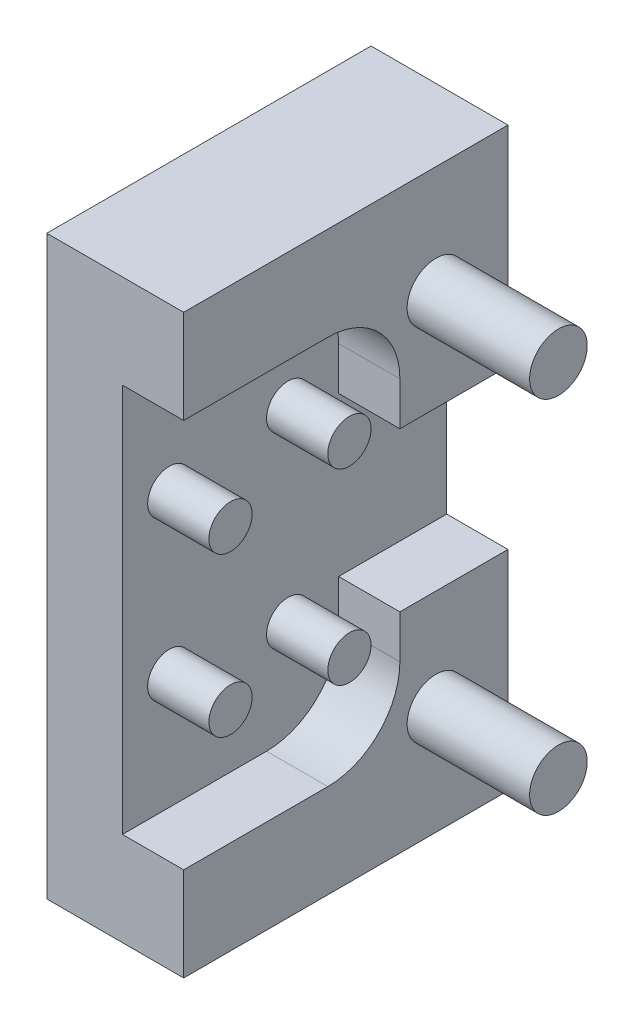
ISO-10303-21;
HEADER;
FILE_DESCRIPTION(('STEP AP214'),'2;1');
FILE_NAME('part.step','',(''),(''),'','','');
FILE_SCHEMA(('AUTOMOTIVE_DESIGN { 1 0 10303 214 1 1 1 1 }'));
ENDSEC;
DATA;
#1=APPLICATION_CONTEXT('core data for automotive mechanical design processes');
#2=APPLICATION_PROTOCOL_DEFINITION('international standard','automotive_design',2000,#1);
#3=PRODUCT_CONTEXT('',#1,'mechanical');
#4=PRODUCT('Part','Part','',(#3));
#5=PRODUCT_RELATED_PRODUCT_CATEGORY('part','',(#4));
#6=PRODUCT_DEFINITION_FORMATION('','',#4);
#7=PRODUCT_DEFINITION_CONTEXT('part definition',#1,'design');
#8=PRODUCT_DEFINITION('design','',#6,#7);
#9=PRODUCT_DEFINITION_SHAPE('','',#8);
#10=(LENGTH_UNIT() NAMED_UNIT(*) SI_UNIT(.MILLI.,.METRE.));
#11=(NAMED_UNIT(*) PLANE_ANGLE_UNIT() SI_UNIT($,.RADIAN.));
#12=(NAMED_UNIT(*) SI_UNIT($,.STERADIAN.) SOLID_ANGLE_UNIT());
#13=UNCERTAINTY_MEASURE_WITH_UNIT(LENGTH_MEASURE(1.E-05),#10,'distance_accuracy_value','');
#14=(GEOMETRIC_REPRESENTATION_CONTEXT(3) GLOBAL_UNCERTAINTY_ASSIGNED_CONTEXT((#13)) GLOBAL_UNIT_ASSIGNED_CONTEXT((#10,
#11,#12)) REPRESENTATION_CONTEXT('',''));
#15=CARTESIAN_POINT('',(0.,0.,0.));
#16=DIRECTION('',(0.,0.,1.));
#17=DIRECTION('',(1.,0.,0.));
#18=AXIS2_PLACEMENT_3D('',#15,#16,#17);
#19=CARTESIAN_POINT('',(-8.5,42.,14.9999999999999));
#20=DIRECTION('',(1.,0.,0.));
#21=DIRECTION('',(0.,1.,0.));
#22=AXIS2_PLACEMENT_3D('',#19,#20,#21);
#23=CYLINDRICAL_SURFACE('',#22,10.);
#24=CARTESIAN_POINT('',(-1.45933612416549E-13,42.,14.9999999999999));
#25=DIRECTION('',(-1.,0.,0.));
#26=DIRECTION('',(0.,1.,0.));
#27=AXIS2_PLACEMENT_3D('',#24,#25,#26);
#28=CIRCLE('',#27,10.);
#29=CARTESIAN_POINT('',(-1.81929124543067E-13,52.,14.9999999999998));
#30=VERTEX_POINT('',#29);
#31=CARTESIAN_POINT('',(-1.45933612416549E-13,42.,4.99999999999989));
#32=VERTEX_POINT('',#31);
#33=EDGE_CURVE('E339',#30,#32,#28,.T.);
#34=ORIENTED_EDGE('',*,*,#33,.F.);
#35=DIRECTION('',(1.,0.,0.));
#36=VECTOR('',#35,1.);
#37=CARTESIAN_POINT('',(-8.5,52.,14.9999999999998));
#38=LINE('',#37,#36);
#39=CARTESIAN_POINT('',(-8.5,52.,14.9999999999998));
#40=VERTEX_POINT('',#39);
#41=EDGE_CURVE('E401',#30,#40,#38,.F.);
#42=ORIENTED_EDGE('',*,*,#41,.T.);
#43=CARTESIAN_POINT('',(-8.5,42.,14.9999999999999));
#44=DIRECTION('',(1.,0.,0.));
#45=DIRECTION('',(0.,1.,0.));
#46=AXIS2_PLACEMENT_3D('',#43,#44,#45);
#47=CIRCLE('',#46,10.);
#48=CARTESIAN_POINT('',(-8.5,42.,4.99999999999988));
#49=VERTEX_POINT('',#48);
#50=EDGE_CURVE('E452',#49,#40,#47,.T.);
#51=ORIENTED_EDGE('',*,*,#50,.F.);
#52=DIRECTION('',(1.,0.,0.));
#53=VECTOR('',#52,1.);
#54=CARTESIAN_POINT('',(-8.5,42.,4.99999999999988));
#55=LINE('',#54,#53);
#56=EDGE_CURVE('E18',#32,#49,#55,.F.);
#57=ORIENTED_EDGE('',*,*,#56,.F.);
#58=EDGE_LOOP('',(#34,#42,#51,#57));
#59=FACE_BOUND('',#58,.T.);
#60=ADVANCED_FACE('F14',(#59),#23,.F.);
#61=CARTESIAN_POINT('',(-8.5,36.,4.99999999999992));
#62=DIRECTION('',(0.,0.,-1.));
#63=DIRECTION('',(-1.,0.,0.));
#64=AXIS2_PLACEMENT_3D('',#61,#62,#63);
#65=PLANE('',#64);
#66=DIRECTION('',(0.,-1.,0.));
#67=VECTOR('',#66,1.);
#68=CARTESIAN_POINT('',(-1.45933612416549E-13,42.,4.99999999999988));
#69=LINE('',#68,#67);
#70=CARTESIAN_POINT('',(-1.25984292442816E-13,36.,4.99999999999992));
#71=VERTEX_POINT('',#70);
#72=EDGE_CURVE('E333',#32,#71,#69,.T.);
#73=ORIENTED_EDGE('',*,*,#72,.F.);
#74=ORIENTED_EDGE('',*,*,#56,.T.);
#75=DIRECTION('',(0.,1.,0.));
#76=VECTOR('',#75,1.);
#77=CARTESIAN_POINT('',(-8.5,8.00000000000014,5.00000000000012));
#78=LINE('',#77,#76);
#79=CARTESIAN_POINT('',(-8.5,36.,4.99999999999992));
#80=VERTEX_POINT('',#79);
#81=EDGE_CURVE('E359',#80,#49,#78,.T.);
#82=ORIENTED_EDGE('',*,*,#81,.F.);
#83=DIRECTION('',(-1.,0.,0.));
#84=VECTOR('',#83,1.);
#85=CARTESIAN_POINT('',(-8.5,36.,4.99999999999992));
#86=LINE('',#85,#84);
#87=EDGE_CURVE('E350',#80,#71,#86,.F.);
#88=ORIENTED_EDGE('',*,*,#87,.T.);
#89=EDGE_LOOP('',(#73,#74,#82,#88));
#90=FACE_BOUND('',#89,.T.);
#91=ADVANCED_FACE('F357',(#90),#65,.F.);
#92=CARTESIAN_POINT('',(-8.5,36.,4.99999999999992));
#93=DIRECTION('',(0.,1.,0.));
#94=DIRECTION('',(0.,0.,1.));
#95=AXIS2_PLACEMENT_3D('',#92,#93,#94);
#96=PLANE('',#95);
#97=DIRECTION('',(0.,0.,-1.));
#98=VECTOR('',#97,1.);
#99=CARTESIAN_POINT('',(-1.25984292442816E-13,36.,4.99999999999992));
#100=LINE('',#99,#98);
#101=CARTESIAN_POINT('',(-1.25984292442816E-13,36.,-10.));
#102=VERTEX_POINT('',#101);
#103=EDGE_CURVE('E336',#71,#102,#100,.T.);
#104=ORIENTED_EDGE('',*,*,#103,.F.);
#105=ORIENTED_EDGE('',*,*,#87,.F.);
#106=DIRECTION('',(0.,0.,1.));
#107=VECTOR('',#106,1.);
#108=CARTESIAN_POINT('',(-8.5,36.,15.));
#109=LINE('',#108,#107);
#110=CARTESIAN_POINT('',(-8.5,36.,-10.));
#111=VERTEX_POINT('',#110);
#112=EDGE_CURVE('E411',#111,#80,#109,.T.);
#113=ORIENTED_EDGE('',*,*,#112,.F.);
#114=DIRECTION('',(-1.,0.,0.));
#115=VECTOR('',#114,1.);
#116=CARTESIAN_POINT('',(0.999999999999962,36.,-10.));
#117=LINE('',#116,#115);
#118=EDGE_CURVE('E352',#111,#102,#117,.F.);
#119=ORIENTED_EDGE('',*,*,#118,.T.);
#120=EDGE_LOOP('',(#104,#105,#113,#119));
#121=FACE_BOUND('',#120,.T.);
#122=ADVANCED_FACE('F349',(#121),#96,.F.);
#123=CARTESIAN_POINT('',(0.999999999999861,65.,-10.0000000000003));
#124=DIRECTION('',(0.,-1.,0.));
#125=DIRECTION('',(1.,0.,0.));
#126=AXIS2_PLACEMENT_3D('',#123,#124,#125);
#127=PLANE('',#126);
#128=DIRECTION('',(0.,0.,1.));
#129=VECTOR('',#128,1.);
#130=CARTESIAN_POINT('',(-2.25947732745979E-13,65.,-10.0000000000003));
#131=LINE('',#130,#129);
#132=CARTESIAN_POINT('',(-2.25947732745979E-13,65.,-10.0000000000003));
#133=VERTEX_POINT('',#132);
#134=CARTESIAN_POINT('',(-2.25947732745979E-13,65.,35.));
#135=VERTEX_POINT('',#134);
#136=EDGE_CURVE('E33',#133,#135,#131,.T.);
#137=ORIENTED_EDGE('',*,*,#136,.F.);
#138=DIRECTION('',(1.,0.,0.));
#139=VECTOR('',#138,1.);
#140=CARTESIAN_POINT('',(0.999999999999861,65.,-10.0000000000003));
#141=LINE('',#140,#139);
#142=CARTESIAN_POINT('',(-19.,65.,-10.0000000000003));
#143=VERTEX_POINT('',#142);
#144=EDGE_CURVE('E424',#133,#143,#141,.F.);
#145=ORIENTED_EDGE('',*,*,#144,.T.);
#146=DIRECTION('',(0.,0.,1.));
#147=VECTOR('',#146,1.);
#148=CARTESIAN_POINT('',(-19.,65.,-10.0000000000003));
#149=LINE('',#148,#147);
#150=CARTESIAN_POINT('',(-19.,65.,35.));
#151=VERTEX_POINT('',#150);
#152=EDGE_CURVE('E472',#151,#143,#149,.F.);
#153=ORIENTED_EDGE('',*,*,#152,.F.);
#154=DIRECTION('',(1.,0.,0.));
#155=VECTOR('',#154,1.);
#156=CARTESIAN_POINT('',(0.999999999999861,65.,35.));
#157=LINE('',#156,#155);
#158=EDGE_CURVE('E464',#135,#151,#157,.F.);
#159=ORIENTED_EDGE('',*,*,#158,.F.);
#160=EDGE_LOOP('',(#137,#145,#153,#159));
#161=FACE_BOUND('',#160,.T.);
#162=ADVANCED_FACE('F1062',(#161),#127,.F.);
#163=CARTESIAN_POINT('',(-8.5,52.,35.));
#164=DIRECTION('',(0.,1.,0.));
#165=DIRECTION('',(0.,0.,1.));
#166=AXIS2_PLACEMENT_3D('',#163,#164,#165);
#167=PLANE('',#166);
#168=DIRECTION('',(0.,0.,-1.));
#169=VECTOR('',#168,1.);
#170=CARTESIAN_POINT('',(-1.81929124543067E-13,52.,35.));
#171=LINE('',#170,#169);
#172=CARTESIAN_POINT('',(-1.81929124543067E-13,52.,35.));
#173=VERTEX_POINT('',#172);
#174=EDGE_CURVE('E1038',#173,#30,#171,.T.);
#175=ORIENTED_EDGE('',*,*,#174,.F.);
#176=DIRECTION('',(1.,0.,0.));
#177=VECTOR('',#176,1.);
#178=CARTESIAN_POINT('',(0.999999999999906,52.,35.));
#179=LINE('',#178,#177);
#180=CARTESIAN_POINT('',(-8.5,52.,35.));
#181=VERTEX_POINT('',#180);
#182=EDGE_CURVE('E480',#173,#181,#179,.F.);
#183=ORIENTED_EDGE('',*,*,#182,.T.);
#184=DIRECTION('',(0.,0.,1.));
#185=VECTOR('',#184,1.);
#186=CARTESIAN_POINT('',(-8.5,52.,14.9999999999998));
#187=LINE('',#186,#185);
#188=EDGE_CURVE('E451',#40,#181,#187,.T.);
#189=ORIENTED_EDGE('',*,*,#188,.F.);
#190=ORIENTED_EDGE('',*,*,#41,.F.);
#191=EDGE_LOOP('',(#175,#183,#189,#190));
#192=FACE_BOUND('',#191,.T.);
#193=ADVANCED_FACE('F1037',(#192),#167,.F.);
#194=CARTESIAN_POINT('',(-8.5,8.00000000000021,15.));
#195=DIRECTION('',(1.,0.,0.));
#196=DIRECTION('',(0.,1.,0.));
#197=AXIS2_PLACEMENT_3D('',#194,#195,#196);
#198=CYLINDRICAL_SURFACE('',#197,10.);
#199=CARTESIAN_POINT('',(0.,8.00000000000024,15.));
#200=DIRECTION('',(-1.,0.,0.));
#201=DIRECTION('',(0.,1.,0.));
#202=AXIS2_PLACEMENT_3D('',#199,#200,#201);
#203=CIRCLE('',#202,10.);
#204=CARTESIAN_POINT('',(0.,8.00000000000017,5.00000000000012));
#205=VERTEX_POINT('',#204);
#206=CARTESIAN_POINT('',(0.,-1.99999999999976,15.));
#207=VERTEX_POINT('',#206);
#208=EDGE_CURVE('E41',#205,#207,#203,.T.);
#209=ORIENTED_EDGE('',*,*,#208,.F.);
#210=DIRECTION('',(1.,0.,0.));
#211=VECTOR('',#210,1.);
#212=CARTESIAN_POINT('',(-8.5,8.00000000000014,5.00000000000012));
#213=LINE('',#212,#211);
#214=CARTESIAN_POINT('',(-8.5,8.00000000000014,5.00000000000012));
#215=VERTEX_POINT('',#214);
#216=EDGE_CURVE('E404',#215,#205,#213,.T.);
#217=ORIENTED_EDGE('',*,*,#216,.F.);
#218=CARTESIAN_POINT('',(-8.5,8.00000000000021,15.));
#219=DIRECTION('',(1.,0.,0.));
#220=DIRECTION('',(0.,1.,0.));
#221=AXIS2_PLACEMENT_3D('',#218,#219,#220);
#222=CIRCLE('',#221,10.);
#223=CARTESIAN_POINT('',(-8.5,-1.99999999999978,15.));
#224=VERTEX_POINT('',#223);
#225=EDGE_CURVE('E446',#224,#215,#222,.T.);
#226=ORIENTED_EDGE('',*,*,#225,.F.);
#227=DIRECTION('',(1.,0.,0.));
#228=VECTOR('',#227,1.);
#229=CARTESIAN_POINT('',(-8.5,-1.99999999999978,15.));
#230=LINE('',#229,#228);
#231=EDGE_CURVE('E445',#224,#207,#230,.T.);
#232=ORIENTED_EDGE('',*,*,#231,.T.);
#233=EDGE_LOOP('',(#209,#217,#226,#232));
#234=FACE_BOUND('',#233,.T.);
#235=ADVANCED_FACE('F1053',(#234),#198,.F.);
#236=CARTESIAN_POINT('',(-8.5,8.00000000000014,5.00000000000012));
#237=DIRECTION('',(0.,0.,-1.));
#238=DIRECTION('',(-1.,0.,0.));
#239=AXIS2_PLACEMENT_3D('',#236,#237,#238);
#240=PLANE('',#239);
#241=DIRECTION('',(0.,-1.,0.));
#242=VECTOR('',#241,1.);
#243=CARTESIAN_POINT('',(0.,14.0000000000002,5.00000000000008));
#244=LINE('',#243,#242);
#245=CARTESIAN_POINT('',(0.,14.0000000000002,5.00000000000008));
#246=VERTEX_POINT('',#245);
#247=EDGE_CURVE('E517',#246,#205,#244,.T.);
#248=ORIENTED_EDGE('',*,*,#247,.F.);
#249=DIRECTION('',(-1.,0.,0.));
#250=VECTOR('',#249,1.);
#251=CARTESIAN_POINT('',(-8.5,14.0000000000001,5.00000000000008));
#252=LINE('',#251,#250);
#253=CARTESIAN_POINT('',(-8.5,14.0000000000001,5.00000000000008));
#254=VERTEX_POINT('',#253);
#255=EDGE_CURVE('E493',#254,#246,#252,.F.);
#256=ORIENTED_EDGE('',*,*,#255,.F.);
#257=DIRECTION('',(0.,1.,0.));
#258=VECTOR('',#257,1.);
#259=CARTESIAN_POINT('',(-8.5,8.00000000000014,5.00000000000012));
#260=LINE('',#259,#258);
#261=EDGE_CURVE('E450',#215,#254,#260,.T.);
#262=ORIENTED_EDGE('',*,*,#261,.F.);
#263=ORIENTED_EDGE('',*,*,#216,.T.);
#264=EDGE_LOOP('',(#248,#256,#262,#263));
#265=FACE_BOUND('',#264,.T.);
#266=ADVANCED_FACE('F1051',(#265),#240,.F.);
#267=CARTESIAN_POINT('',(-8.5,14.0000000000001,5.00000000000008));
#268=DIRECTION('',(0.,-1.,0.));
#269=DIRECTION('',(0.,0.,-1.));
#270=AXIS2_PLACEMENT_3D('',#267,#268,#269);
#271=PLANE('',#270);
#272=DIRECTION('',(0.,0.,1.));
#273=VECTOR('',#272,1.);
#274=CARTESIAN_POINT('',(0.,14.,-10.));
#275=LINE('',#274,#273);
#276=CARTESIAN_POINT('',(0.,14.,-10.));
#277=VERTEX_POINT('',#276);
#278=EDGE_CURVE('E514',#277,#246,#275,.T.);
#279=ORIENTED_EDGE('',*,*,#278,.F.);
#280=DIRECTION('',(-1.,0.,0.));
#281=VECTOR('',#280,1.);
#282=CARTESIAN_POINT('',(-8.5,14.,-10.));
#283=LINE('',#282,#281);
#284=CARTESIAN_POINT('',(-8.5,14.,-10.));
#285=VERTEX_POINT('',#284);
#286=EDGE_CURVE('E371',#285,#277,#283,.F.);
#287=ORIENTED_EDGE('',*,*,#286,.F.);
#288=DIRECTION('',(0.,0.,1.));
#289=VECTOR('',#288,1.);
#290=CARTESIAN_POINT('',(-8.5,14.0000000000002,15.));
#291=LINE('',#290,#289);
#292=EDGE_CURVE('E403',#254,#285,#291,.F.);
#293=ORIENTED_EDGE('',*,*,#292,.F.);
#294=ORIENTED_EDGE('',*,*,#255,.T.);
#295=EDGE_LOOP('',(#279,#287,#293,#294));
#296=FACE_BOUND('',#295,.T.);
#297=ADVANCED_FACE('F512',(#296),#271,.F.);
#298=CARTESIAN_POINT('',(0.999999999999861,65.,-10.0000000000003));
#299=DIRECTION('',(0.,0.,1.));
#300=DIRECTION('',(0.,-1.,0.));
#301=AXIS2_PLACEMENT_3D('',#298,#299,#300);
#302=PLANE('',#301);
#303=DIRECTION('',(0.,1.,0.));
#304=VECTOR('',#303,1.);
#305=CARTESIAN_POINT('',(-1.25984292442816E-13,36.,-10.));
#306=LINE('',#305,#304);
#307=EDGE_CURVE('E354',#102,#133,#306,.T.);
#308=ORIENTED_EDGE('',*,*,#307,.F.);
#309=ORIENTED_EDGE('',*,*,#118,.F.);
#310=DIRECTION('',(0.,-1.,0.));
#311=VECTOR('',#310,1.);
#312=CARTESIAN_POINT('',(-8.5,8.,-9.99999999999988));
#313=LINE('',#312,#311);
#314=EDGE_CURVE('E361',#111,#285,#313,.T.);
#315=ORIENTED_EDGE('',*,*,#314,.T.);
#316=ORIENTED_EDGE('',*,*,#286,.T.);
#317=DIRECTION('',(0.,1.,0.));
#318=VECTOR('',#317,1.);
#319=CARTESIAN_POINT('',(0.,-15.,-9.99999999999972));
#320=LINE('',#319,#318);
#321=CARTESIAN_POINT('',(0.,-15.,-9.99999999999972));
#322=VERTEX_POINT('',#321);
#323=EDGE_CURVE('E506',#322,#277,#320,.T.);
#324=ORIENTED_EDGE('',*,*,#323,.F.);
#325=DIRECTION('',(1.,0.,0.));
#326=VECTOR('',#325,1.);
#327=CARTESIAN_POINT('',(1.00000000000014,-15.,-9.99999999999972));
#328=LINE('',#327,#326);
#329=CARTESIAN_POINT('',(-19.,-15.,-9.99999999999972));
#330=VERTEX_POINT('',#329);
#331=EDGE_CURVE('E458',#322,#330,#328,.F.);
#332=ORIENTED_EDGE('',*,*,#331,.T.);
#333=DIRECTION('',(0.,-1.,0.));
#334=VECTOR('',#333,1.);
#335=CARTESIAN_POINT('',(-19.,25.,-10.));
#336=LINE('',#335,#334);
#337=EDGE_CURVE('E467',#330,#143,#336,.F.);
#338=ORIENTED_EDGE('',*,*,#337,.T.);
#339=ORIENTED_EDGE('',*,*,#144,.F.);
#340=EDGE_LOOP('',(#308,#309,#315,#316,#324,#332,#338,#339));
#341=FACE_BOUND('',#340,.T.);
#342=ADVANCED_FACE('F505',(#341),#302,.F.);
#343=CARTESIAN_POINT('',(1.00000000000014,-15.,-9.99999999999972));
#344=DIRECTION('',(0.,1.,0.));
#345=DIRECTION('',(-1.,0.,0.));
#346=AXIS2_PLACEMENT_3D('',#343,#344,#345);
#347=PLANE('',#346);
#348=DIRECTION('',(0.,0.,-1.));
#349=VECTOR('',#348,1.);
#350=CARTESIAN_POINT('',(0.,-14.9999999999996,35.));
#351=LINE('',#350,#349);
#352=CARTESIAN_POINT('',(0.,-14.9999999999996,35.));
#353=VERTEX_POINT('',#352);
#354=EDGE_CURVE('E520',#353,#322,#351,.T.);
#355=ORIENTED_EDGE('',*,*,#354,.F.);
#356=DIRECTION('',(1.,0.,0.));
#357=VECTOR('',#356,1.);
#358=CARTESIAN_POINT('',(1.00000000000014,-14.9999999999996,35.));
#359=LINE('',#358,#357);
#360=CARTESIAN_POINT('',(-19.,-14.9999999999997,35.));
#361=VERTEX_POINT('',#360);
#362=EDGE_CURVE('E461',#353,#361,#359,.F.);
#363=ORIENTED_EDGE('',*,*,#362,.T.);
#364=DIRECTION('',(0.,0.,1.));
#365=VECTOR('',#364,1.);
#366=CARTESIAN_POINT('',(-19.,-14.9999999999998,12.5000000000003));
#367=LINE('',#366,#365);
#368=EDGE_CURVE('E476',#361,#330,#367,.F.);
#369=ORIENTED_EDGE('',*,*,#368,.T.);
#370=ORIENTED_EDGE('',*,*,#331,.F.);
#371=EDGE_LOOP('',(#355,#363,#369,#370));
#372=FACE_BOUND('',#371,.T.);
#373=ADVANCED_FACE('F1123',(#372),#347,.F.);
#374=CARTESIAN_POINT('',(0.999999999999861,65.,35.));
#375=DIRECTION('',(0.,0.,-1.));
#376=DIRECTION('',(-1.,0.,0.));
#377=AXIS2_PLACEMENT_3D('',#374,#375,#376);
#378=PLANE('',#377);
#379=DIRECTION('',(0.,-1.,0.));
#380=VECTOR('',#379,1.);
#381=CARTESIAN_POINT('',(-2.25947732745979E-13,65.,35.));
#382=LINE('',#381,#380);
#383=EDGE_CURVE('E1124',#135,#173,#382,.T.);
#384=ORIENTED_EDGE('',*,*,#383,.F.);
#385=ORIENTED_EDGE('',*,*,#158,.T.);
#386=DIRECTION('',(0.,1.,0.));
#387=VECTOR('',#386,1.);
#388=CARTESIAN_POINT('',(-19.,25.,35.));
#389=LINE('',#388,#387);
#390=EDGE_CURVE('E468',#151,#361,#389,.F.);
#391=ORIENTED_EDGE('',*,*,#390,.T.);
#392=ORIENTED_EDGE('',*,*,#362,.F.);
#393=DIRECTION('',(0.,-1.,0.));
#394=VECTOR('',#393,1.);
#395=CARTESIAN_POINT('',(0.,-1.99999999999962,35.));
#396=LINE('',#395,#394);
#397=CARTESIAN_POINT('',(0.,-1.99999999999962,35.));
#398=VERTEX_POINT('',#397);
#399=EDGE_CURVE('E528',#398,#353,#396,.T.);
#400=ORIENTED_EDGE('',*,*,#399,.F.);
#401=DIRECTION('',(1.,0.,0.));
#402=VECTOR('',#401,1.);
#403=CARTESIAN_POINT('',(-8.5,-1.99999999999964,35.));
#404=LINE('',#403,#402);
#405=CARTESIAN_POINT('',(-8.5,-1.99999999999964,35.));
#406=VERTEX_POINT('',#405);
#407=EDGE_CURVE('E486',#398,#406,#404,.F.);
#408=ORIENTED_EDGE('',*,*,#407,.T.);
#409=DIRECTION('',(0.,-1.,0.));
#410=VECTOR('',#409,1.);
#411=CARTESIAN_POINT('',(-8.50000000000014,65.,35.));
#412=LINE('',#411,#410);
#413=EDGE_CURVE('E489',#181,#406,#412,.T.);
#414=ORIENTED_EDGE('',*,*,#413,.F.);
#415=ORIENTED_EDGE('',*,*,#182,.F.);
#416=EDGE_LOOP('',(#384,#385,#391,#392,#400,#408,#414,#415));
#417=FACE_BOUND('',#416,.T.);
#418=ADVANCED_FACE('F1042',(#417),#378,.F.);
#419=CARTESIAN_POINT('',(-8.5,-1.99999999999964,35.));
#420=DIRECTION('',(0.,-1.,0.));
#421=DIRECTION('',(0.,0.,-1.));
#422=AXIS2_PLACEMENT_3D('',#419,#420,#421);
#423=PLANE('',#422);
#424=DIRECTION('',(0.,0.,1.));
#425=VECTOR('',#424,1.);
#426=CARTESIAN_POINT('',(0.,-1.99999999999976,15.));
#427=LINE('',#426,#425);
#428=EDGE_CURVE('E531',#207,#398,#427,.T.);
#429=ORIENTED_EDGE('',*,*,#428,.F.);
#430=ORIENTED_EDGE('',*,*,#231,.F.);
#431=DIRECTION('',(0.,0.,-1.));
#432=VECTOR('',#431,1.);
#433=CARTESIAN_POINT('',(-8.5,-1.99999999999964,35.));
#434=LINE('',#433,#432);
#435=EDGE_CURVE('E1005',#406,#224,#434,.T.);
#436=ORIENTED_EDGE('',*,*,#435,.F.);
#437=ORIENTED_EDGE('',*,*,#407,.F.);
#438=EDGE_LOOP('',(#429,#430,#436,#437));
#439=FACE_BOUND('',#438,.T.);
#440=ADVANCED_FACE('F1049',(#439),#423,.F.);
#441=CARTESIAN_POINT('',(-14.74,-5.19615242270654,3.00000000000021));
#442=DIRECTION('',(1.,0.,0.));
#443=DIRECTION('',(0.,-0.499999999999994,0.866025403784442));
#444=AXIS2_PLACEMENT_3D('',#441,#442,#443);
#445=PLANE('',#444);
#446=DIRECTION('',(0.,0.499999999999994,-0.866025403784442));
#447=VECTOR('',#446,1.);
#448=CARTESIAN_POINT('',(-14.74,1.732050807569,3.00000000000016));
#449=LINE('',#448,#447);
#450=CARTESIAN_POINT('',(-14.74,1.732050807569,3.00000000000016));
#451=VERTEX_POINT('',#450);
#452=CARTESIAN_POINT('',(-14.74,3.46410161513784,1.50920942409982E-13));
#453=VERTEX_POINT('',#452);
#454=EDGE_CURVE('E602',#451,#453,#449,.T.);
#455=ORIENTED_EDGE('',*,*,#454,.T.);
#456=DIRECTION('',(0.,-0.500000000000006,-0.866025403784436));
#457=VECTOR('',#456,1.);
#458=CARTESIAN_POINT('',(-14.74,3.46410161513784,1.50920942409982E-13));
#459=LINE('',#458,#457);
#460=CARTESIAN_POINT('',(-14.74,1.73205080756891,-2.99999999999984));
#461=VERTEX_POINT('',#460);
#462=EDGE_CURVE('E595',#453,#461,#459,.T.);
#463=ORIENTED_EDGE('',*,*,#462,.T.);
#464=DIRECTION('',(0.,1.,0.));
#465=VECTOR('',#464,1.);
#466=CARTESIAN_POINT('',(-14.74,-1.73205080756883,-2.99999999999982));
#467=LINE('',#466,#465);
#468=CARTESIAN_POINT('',(-14.74,-1.73205080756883,-2.99999999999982));
#469=VERTEX_POINT('',#468);
#470=EDGE_CURVE('E591',#469,#461,#467,.T.);
#471=ORIENTED_EDGE('',*,*,#470,.F.);
#472=DIRECTION('',(0.,0.499999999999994,-0.866025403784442));
#473=VECTOR('',#472,1.);
#474=CARTESIAN_POINT('',(-14.74,-3.46410161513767,1.99493199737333E-13));
#475=LINE('',#474,#473);
#476=CARTESIAN_POINT('',(-14.74,-3.46410161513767,1.99493199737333E-13));
#477=VERTEX_POINT('',#476);
#478=EDGE_CURVE('E583',#477,#469,#475,.T.);
#479=ORIENTED_EDGE('',*,*,#478,.F.);
#480=DIRECTION('',(0.,0.500000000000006,0.866025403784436));
#481=VECTOR('',#480,1.);
#482=CARTESIAN_POINT('',(-14.74,-3.46410161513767,1.99493199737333E-13));
#483=LINE('',#482,#481);
#484=CARTESIAN_POINT('',(-14.74,-1.7320508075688,3.00000000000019));
#485=VERTEX_POINT('',#484);
#486=EDGE_CURVE('E572',#477,#485,#483,.T.);
#487=ORIENTED_EDGE('',*,*,#486,.T.);
#488=DIRECTION('',(0.,-1.,0.));
#489=VECTOR('',#488,1.);
#490=CARTESIAN_POINT('',(-14.74,1.732050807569,3.00000000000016));
#491=LINE('',#490,#489);
#492=EDGE_CURVE('E564',#451,#485,#491,.T.);
#493=ORIENTED_EDGE('',*,*,#492,.F.);
#494=EDGE_LOOP('',(#455,#463,#471,#479,#487,#493));
#495=FACE_BOUND('',#494,.T.);
#496=ADVANCED_FACE('F1158',(#495),#445,.F.);
#497=CARTESIAN_POINT('',(-14.74,1.732050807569,3.00000000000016));
#498=DIRECTION('',(0.,0.,-1.));
#499=DIRECTION('',(0.,-1.,0.));
#500=AXIS2_PLACEMENT_3D('',#497,#498,#499);
#501=PLANE('',#500);
#502=ORIENTED_EDGE('',*,*,#492,.T.);
#503=DIRECTION('',(-1.,0.,0.));
#504=VECTOR('',#503,1.);
#505=CARTESIAN_POINT('',(-14.74,-1.7320508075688,3.00000000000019));
#506=LINE('',#505,#504);
#507=CARTESIAN_POINT('',(-19.,-1.73205080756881,3.00000000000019));
#508=VERTEX_POINT('',#507);
#509=EDGE_CURVE('E560',#485,#508,#506,.T.);
#510=ORIENTED_EDGE('',*,*,#509,.T.);
#511=DIRECTION('',(0.,1.,0.));
#512=VECTOR('',#511,1.);
#513=CARTESIAN_POINT('',(-19.,-1.73205080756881,3.00000000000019));
#514=LINE('',#513,#512);
#515=CARTESIAN_POINT('',(-19.,1.73205080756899,3.00000000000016));
#516=VERTEX_POINT('',#515);
#517=EDGE_CURVE('E540',#508,#516,#514,.T.);
#518=ORIENTED_EDGE('',*,*,#517,.T.);
#519=DIRECTION('',(-1.,0.,0.));
#520=VECTOR('',#519,1.);
#521=CARTESIAN_POINT('',(-14.74,1.732050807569,3.00000000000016));
#522=LINE('',#521,#520);
#523=EDGE_CURVE('E568',#516,#451,#522,.F.);
#524=ORIENTED_EDGE('',*,*,#523,.T.);
#525=EDGE_LOOP('',(#502,#510,#518,#524));
#526=FACE_BOUND('',#525,.T.);
#527=ADVANCED_FACE('F1154',(#526),#501,.T.);
#528=CARTESIAN_POINT('',(-14.74,1.732050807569,3.00000000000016));
#529=DIRECTION('',(0.,0.866025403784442,0.499999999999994));
#530=DIRECTION('',(0.,0.499999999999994,-0.866025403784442));
#531=AXIS2_PLACEMENT_3D('',#528,#529,#530);
#532=PLANE('',#531);
#533=DIRECTION('',(-1.,0.,0.));
#534=VECTOR('',#533,1.);
#535=CARTESIAN_POINT('',(-14.74,3.46410161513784,1.50920942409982E-13));
#536=LINE('',#535,#534);
#537=CARTESIAN_POINT('',(-19.,3.46410161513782,1.50920942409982E-13));
#538=VERTEX_POINT('',#537);
#539=EDGE_CURVE('E598',#538,#453,#536,.F.);
#540=ORIENTED_EDGE('',*,*,#539,.T.);
#541=ORIENTED_EDGE('',*,*,#454,.F.);
#542=ORIENTED_EDGE('',*,*,#523,.F.);
#543=DIRECTION('',(0.,-0.499999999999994,0.866025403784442));
#544=VECTOR('',#543,1.);
#545=CARTESIAN_POINT('',(-19.,2.59807621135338,1.50000000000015));
#546=LINE('',#545,#544);
#547=EDGE_CURVE('E557',#516,#538,#546,.F.);
#548=ORIENTED_EDGE('',*,*,#547,.T.);
#549=EDGE_LOOP('',(#540,#541,#542,#548));
#550=FACE_BOUND('',#549,.T.);
#551=ADVANCED_FACE('F1157',(#550),#532,.F.);
#552=CARTESIAN_POINT('',(-14.74,3.46410161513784,1.50920942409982E-13));
#553=DIRECTION('',(0.,0.866025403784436,-0.500000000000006));
#554=DIRECTION('',(0.,-0.500000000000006,-0.866025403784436));
#555=AXIS2_PLACEMENT_3D('',#552,#553,#554);
#556=PLANE('',#555);
#557=DIRECTION('',(-1.,0.,0.));
#558=VECTOR('',#557,1.);
#559=CARTESIAN_POINT('',(-14.74,1.73205080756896,-2.99999999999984));
#560=LINE('',#559,#558);
#561=CARTESIAN_POINT('',(-19.,1.7320508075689,-2.99999999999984));
#562=VERTEX_POINT('',#561);
#563=EDGE_CURVE('E587',#461,#562,#560,.T.);
#564=ORIENTED_EDGE('',*,*,#563,.F.);
#565=ORIENTED_EDGE('',*,*,#462,.F.);
#566=ORIENTED_EDGE('',*,*,#539,.F.);
#567=DIRECTION('',(0.,-0.500000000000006,-0.866025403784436));
#568=VECTOR('',#567,1.);
#569=CARTESIAN_POINT('',(-19.,3.46410161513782,1.50920942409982E-13));
#570=LINE('',#569,#568);
#571=EDGE_CURVE('E554',#538,#562,#570,.T.);
#572=ORIENTED_EDGE('',*,*,#571,.T.);
#573=EDGE_LOOP('',(#564,#565,#566,#572));
#574=FACE_BOUND('',#573,.T.);
#575=ADVANCED_FACE('F1172',(#574),#556,.F.);
#576=CARTESIAN_POINT('',(-14.74,-1.73205080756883,-2.99999999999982));
#577=DIRECTION('',(0.,0.,1.));
#578=DIRECTION('',(0.,1.,0.));
#579=AXIS2_PLACEMENT_3D('',#576,#577,#578);
#580=PLANE('',#579);
#581=ORIENTED_EDGE('',*,*,#470,.T.);
#582=ORIENTED_EDGE('',*,*,#563,.T.);
#583=DIRECTION('',(0.,-1.,0.));
#584=VECTOR('',#583,1.);
#585=CARTESIAN_POINT('',(-19.,1.7320508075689,-2.99999999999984));
#586=LINE('',#585,#584);
#587=CARTESIAN_POINT('',(-19.,-1.73205080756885,-2.99999999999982));
#588=VERTEX_POINT('',#587);
#589=EDGE_CURVE('E551',#562,#588,#586,.T.);
#590=ORIENTED_EDGE('',*,*,#589,.T.);
#591=DIRECTION('',(-1.,0.,0.));
#592=VECTOR('',#591,1.);
#593=CARTESIAN_POINT('',(-14.74,-1.73205080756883,-2.99999999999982));
#594=LINE('',#593,#592);
#595=EDGE_CURVE('E579',#469,#588,#594,.T.);
#596=ORIENTED_EDGE('',*,*,#595,.F.);
#597=EDGE_LOOP('',(#581,#582,#590,#596));
#598=FACE_BOUND('',#597,.T.);
#599=ADVANCED_FACE('F1168',(#598),#580,.T.);
#600=CARTESIAN_POINT('',(-14.74,-3.46410161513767,1.99493199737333E-13));
#601=DIRECTION('',(0.,0.866025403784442,0.499999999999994));
#602=DIRECTION('',(0.,0.499999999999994,-0.866025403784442));
#603=AXIS2_PLACEMENT_3D('',#600,#601,#602);
#604=PLANE('',#603);
#605=ORIENTED_EDGE('',*,*,#478,.T.);
#606=ORIENTED_EDGE('',*,*,#595,.T.);
#607=DIRECTION('',(0.,-0.499999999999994,0.866025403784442));
#608=VECTOR('',#607,1.);
#609=CARTESIAN_POINT('',(-19.,-2.59807621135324,-1.49999999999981));
#610=LINE('',#609,#608);
#611=CARTESIAN_POINT('',(-19.,-3.46410161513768,1.99493199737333E-13));
#612=VERTEX_POINT('',#611);
#613=EDGE_CURVE('E548',#588,#612,#610,.T.);
#614=ORIENTED_EDGE('',*,*,#613,.T.);
#615=DIRECTION('',(-1.,0.,0.));
#616=VECTOR('',#615,1.);
#617=CARTESIAN_POINT('',(-14.74,-3.46410161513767,1.99493199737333E-13));
#618=LINE('',#617,#616);
#619=EDGE_CURVE('E575',#612,#477,#618,.F.);
#620=ORIENTED_EDGE('',*,*,#619,.T.);
#621=EDGE_LOOP('',(#605,#606,#614,#620));
#622=FACE_BOUND('',#621,.T.);
#623=ADVANCED_FACE('F1164',(#622),#604,.T.);
#624=CARTESIAN_POINT('',(-14.74,-3.46410161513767,1.99493199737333E-13));
#625=DIRECTION('',(0.,-0.866025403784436,0.500000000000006));
#626=DIRECTION('',(0.,0.500000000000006,0.866025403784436));
#627=AXIS2_PLACEMENT_3D('',#624,#625,#626);
#628=PLANE('',#627);
#629=ORIENTED_EDGE('',*,*,#509,.F.);
#630=ORIENTED_EDGE('',*,*,#486,.F.);
#631=ORIENTED_EDGE('',*,*,#619,.F.);
#632=DIRECTION('',(0.,0.500000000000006,0.866025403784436));
#633=VECTOR('',#632,1.);
#634=CARTESIAN_POINT('',(-19.,-3.46410161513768,1.99493199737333E-13));
#635=LINE('',#634,#633);
#636=EDGE_CURVE('E545',#612,#508,#635,.T.);
#637=ORIENTED_EDGE('',*,*,#636,.T.);
#638=EDGE_LOOP('',(#629,#630,#631,#637));
#639=FACE_BOUND('',#638,.T.);
#640=ADVANCED_FACE('F1160',(#639),#628,.F.);
#641=CARTESIAN_POINT('',(-19.,-5.282754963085,-3.04999999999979));
#642=DIRECTION('',(1.,0.,0.));
#643=DIRECTION('',(0.,-0.499999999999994,0.866025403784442));
#644=AXIS2_PLACEMENT_3D('',#641,#642,#643);
#645=PLANE('',#644);
#646=CARTESIAN_POINT('',(-19.,0.,1.75207071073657E-13));
#647=DIRECTION('',(1.,0.,0.));
#648=DIRECTION('',(0.,-0.499999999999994,0.866025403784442));
#649=AXIS2_PLACEMENT_3D('',#646,#647,#648);
#650=CIRCLE('',#649,6.5);
#651=CARTESIAN_POINT('',(-19.,-3.24999999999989,5.62916512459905));
#652=VERTEX_POINT('',#651);
#653=EDGE_CURVE('E25',#652,#652,#650,.T.);
#654=ORIENTED_EDGE('',*,*,#653,.F.);
#655=EDGE_LOOP('',(#654));
#656=FACE_BOUND('',#655,.T.);
#657=ORIENTED_EDGE('',*,*,#636,.F.);
#658=ORIENTED_EDGE('',*,*,#613,.F.);
#659=ORIENTED_EDGE('',*,*,#589,.F.);
#660=ORIENTED_EDGE('',*,*,#571,.F.);
#661=ORIENTED_EDGE('',*,*,#547,.F.);
#662=ORIENTED_EDGE('',*,*,#517,.F.);
#663=EDGE_LOOP('',(#657,#658,#659,#660,#661,#662));
#664=FACE_BOUND('',#663,.T.);
#665=ADVANCED_FACE('F1163',(#656,#664),#645,.F.);
#666=CARTESIAN_POINT('',(-13.,0.,1.75207071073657E-13));
#667=DIRECTION('',(-1.,0.,0.));
#668=DIRECTION('',(0.,0.499999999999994,-0.866025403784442));
#669=AXIS2_PLACEMENT_3D('',#666,#667,#668);
#670=CYLINDRICAL_SURFACE('',#669,6.5);
#671=CARTESIAN_POINT('',(-13.,0.,1.75207071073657E-13));
#672=DIRECTION('',(-1.,0.,0.));
#673=DIRECTION('',(0.,0.499999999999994,-0.866025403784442));
#674=AXIS2_PLACEMENT_3D('',#671,#672,#673);
#675=CIRCLE('',#674,6.5);
#676=CARTESIAN_POINT('',(-13.,3.25000000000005,-5.6291651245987));
#677=VERTEX_POINT('',#676);
#678=EDGE_CURVE('E544',#677,#677,#675,.T.);
#679=ORIENTED_EDGE('',*,*,#678,.T.);
#680=EDGE_LOOP('',(#679));
#681=FACE_BOUND('',#680,.T.);
#682=ORIENTED_EDGE('',*,*,#653,.T.);
#683=EDGE_LOOP('',(#682));
#684=FACE_BOUND('',#683,.T.);
#685=ADVANCED_FACE('F1185',(#681,#684),#670,.T.);
#686=CARTESIAN_POINT('',(-14.74,44.8038475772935,2.99999999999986));
#687=DIRECTION('',(1.,0.,0.));
#688=DIRECTION('',(0.,-0.499999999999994,0.866025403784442));
#689=AXIS2_PLACEMENT_3D('',#686,#687,#688);
#690=PLANE('',#689);
#691=DIRECTION('',(0.,0.499999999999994,-0.866025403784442));
#692=VECTOR('',#691,1.);
#693=CARTESIAN_POINT('',(-14.74,51.732050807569,2.99999999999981));
#694=LINE('',#693,#692);
#695=CARTESIAN_POINT('',(-14.74,51.732050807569,2.99999999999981));
#696=VERTEX_POINT('',#695);
#697=CARTESIAN_POINT('',(-14.74,53.4641016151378,-1.99493199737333E-13));
#698=VERTEX_POINT('',#697);
#699=EDGE_CURVE('E914',#696,#698,#694,.T.);
#700=ORIENTED_EDGE('',*,*,#699,.T.);
#701=DIRECTION('',(0.,-0.500000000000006,-0.866025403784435));
#702=VECTOR('',#701,1.);
#703=CARTESIAN_POINT('',(-14.74,53.4641016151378,-1.99493199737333E-13));
#704=LINE('',#703,#702);
#705=CARTESIAN_POINT('',(-14.74,51.732050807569,-3.00000000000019));
#706=VERTEX_POINT('',#705);
#707=EDGE_CURVE('E907',#698,#706,#704,.T.);
#708=ORIENTED_EDGE('',*,*,#707,.T.);
#709=DIRECTION('',(0.,1.,0.));
#710=VECTOR('',#709,1.);
#711=CARTESIAN_POINT('',(-14.74,48.2679491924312,-3.00000000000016));
#712=LINE('',#711,#710);
#713=CARTESIAN_POINT('',(-14.74,48.2679491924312,-3.00000000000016));
#714=VERTEX_POINT('',#713);
#715=EDGE_CURVE('E903',#714,#706,#712,.T.);
#716=ORIENTED_EDGE('',*,*,#715,.F.);
#717=DIRECTION('',(0.,0.499999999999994,-0.866025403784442));
#718=VECTOR('',#717,1.);
#719=CARTESIAN_POINT('',(-14.74,46.5358983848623,-1.50920942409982E-13));
#720=LINE('',#719,#718);
#721=CARTESIAN_POINT('',(-14.74,46.5358983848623,-1.50920942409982E-13));
#722=VERTEX_POINT('',#721);
#723=EDGE_CURVE('E895',#722,#714,#720,.T.);
#724=ORIENTED_EDGE('',*,*,#723,.F.);
#725=DIRECTION('',(0.,0.500000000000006,0.866025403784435));
#726=VECTOR('',#725,1.);
#727=CARTESIAN_POINT('',(-14.74,46.5358983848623,-1.50920942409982E-13));
#728=LINE('',#727,#726);
#729=CARTESIAN_POINT('',(-14.74,48.2679491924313,2.99999999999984));
#730=VERTEX_POINT('',#729);
#731=EDGE_CURVE('E884',#722,#730,#728,.T.);
#732=ORIENTED_EDGE('',*,*,#731,.T.);
#733=DIRECTION('',(0.,-1.,0.));
#734=VECTOR('',#733,1.);
#735=CARTESIAN_POINT('',(-14.74,51.732050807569,2.99999999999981));
#736=LINE('',#735,#734);
#737=EDGE_CURVE('E876',#696,#730,#736,.T.);
#738=ORIENTED_EDGE('',*,*,#737,.F.);
#739=EDGE_LOOP('',(#700,#708,#716,#724,#732,#738));
#740=FACE_BOUND('',#739,.T.);
#741=ADVANCED_FACE('F1189',(#740),#690,.F.);
#742=CARTESIAN_POINT('',(-13.305,38.8867513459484,28.5));
#743=DIRECTION('',(-1.,0.,0.));
#744=DIRECTION('',(0.,-1.,0.));
#745=AXIS2_PLACEMENT_3D('',#742,#743,#744);
#746=PLANE('',#745);
#747=DIRECTION('',(0.,-1.,0.));
#748=VECTOR('',#747,1.);
#749=CARTESIAN_POINT('',(-13.305,37.4433756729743,31.));
#750=LINE('',#749,#748);
#751=CARTESIAN_POINT('',(-13.305,37.4433756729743,31.));
#752=VERTEX_POINT('',#751);
#753=CARTESIAN_POINT('',(-13.305,34.5566243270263,31.));
#754=VERTEX_POINT('',#753);
#755=EDGE_CURVE('E655',#752,#754,#750,.T.);
#756=ORIENTED_EDGE('',*,*,#755,.F.);
#757=DIRECTION('',(0.,0.499999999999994,-0.866025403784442));
#758=VECTOR('',#757,1.);
#759=CARTESIAN_POINT('',(-13.305,37.4433756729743,31.));
#760=LINE('',#759,#758);
#761=CARTESIAN_POINT('',(-13.305,38.8867513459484,28.5));
#762=VERTEX_POINT('',#761);
#763=EDGE_CURVE('E644',#752,#762,#760,.T.);
#764=ORIENTED_EDGE('',*,*,#763,.T.);
#765=DIRECTION('',(0.,0.500000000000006,0.866025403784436));
#766=VECTOR('',#765,1.);
#767=CARTESIAN_POINT('',(-13.305,37.4433756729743,26.));
#768=LINE('',#767,#766);
#769=CARTESIAN_POINT('',(-13.305,37.4433756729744,26.));
#770=VERTEX_POINT('',#769);
#771=EDGE_CURVE('E636',#770,#762,#768,.T.);
#772=ORIENTED_EDGE('',*,*,#771,.F.);
#773=DIRECTION('',(0.,-1.,0.));
#774=VECTOR('',#773,1.);
#775=CARTESIAN_POINT('',(-13.305,37.4433756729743,26.));
#776=LINE('',#775,#774);
#777=CARTESIAN_POINT('',(-13.305,34.5566243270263,26.));
#778=VERTEX_POINT('',#777);
#779=EDGE_CURVE('E674',#770,#778,#776,.T.);
#780=ORIENTED_EDGE('',*,*,#779,.T.);
#781=DIRECTION('',(0.,-0.499999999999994,0.866025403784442));
#782=VECTOR('',#781,1.);
#783=CARTESIAN_POINT('',(-13.305,34.5566243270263,26.));
#784=LINE('',#783,#782);
#785=CARTESIAN_POINT('',(-13.305,33.1132486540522,28.5));
#786=VERTEX_POINT('',#785);
#787=EDGE_CURVE('E667',#778,#786,#784,.T.);
#788=ORIENTED_EDGE('',*,*,#787,.T.);
#789=DIRECTION('',(0.,-0.500000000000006,-0.866025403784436));
#790=VECTOR('',#789,1.);
#791=CARTESIAN_POINT('',(-13.305,34.5566243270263,31.));
#792=LINE('',#791,#790);
#793=EDGE_CURVE('E663',#754,#786,#792,.T.);
#794=ORIENTED_EDGE('',*,*,#793,.F.);
#795=EDGE_LOOP('',(#756,#764,#772,#780,#788,#794));
#796=FACE_BOUND('',#795,.T.);
#797=ADVANCED_FACE('F1225',(#796),#746,.T.);
#798=CARTESIAN_POINT('',(-13.305,40.8867513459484,12.));
#799=DIRECTION('',(-1.,0.,0.));
#800=DIRECTION('',(0.,-1.,0.));
#801=AXIS2_PLACEMENT_3D('',#798,#799,#800);
#802=PLANE('',#801);
#803=DIRECTION('',(0.,-1.,0.));
#804=VECTOR('',#803,1.);
#805=CARTESIAN_POINT('',(-13.305,39.4433756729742,14.5));
#806=LINE('',#805,#804);
#807=CARTESIAN_POINT('',(-13.305,39.4433756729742,14.5));
#808=VERTEX_POINT('',#807);
#809=CARTESIAN_POINT('',(-13.305,36.5566243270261,14.5));
#810=VERTEX_POINT('',#809);
#811=EDGE_CURVE('E970',#808,#810,#806,.T.);
#812=ORIENTED_EDGE('',*,*,#811,.F.);
#813=DIRECTION('',(0.,0.499999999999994,-0.866025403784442));
#814=VECTOR('',#813,1.);
#815=CARTESIAN_POINT('',(-13.305,39.4433756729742,14.5));
#816=LINE('',#815,#814);
#817=CARTESIAN_POINT('',(-13.305,40.8867513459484,12.));
#818=VERTEX_POINT('',#817);
#819=EDGE_CURVE('E959',#808,#818,#816,.T.);
#820=ORIENTED_EDGE('',*,*,#819,.T.);
#821=DIRECTION('',(0.,0.500000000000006,0.866025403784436));
#822=VECTOR('',#821,1.);
#823=CARTESIAN_POINT('',(-13.305,39.4433756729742,9.4999999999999));
#824=LINE('',#823,#822);
#825=CARTESIAN_POINT('',(-13.305,39.4433756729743,9.4999999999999));
#826=VERTEX_POINT('',#825);
#827=EDGE_CURVE('E951',#826,#818,#824,.T.);
#828=ORIENTED_EDGE('',*,*,#827,.F.);
#829=DIRECTION('',(0.,-1.,0.));
#830=VECTOR('',#829,1.);
#831=CARTESIAN_POINT('',(-13.305,39.4433756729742,9.4999999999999));
#832=LINE('',#831,#830);
#833=CARTESIAN_POINT('',(-13.305,36.5566243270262,9.5));
#834=VERTEX_POINT('',#833);
#835=EDGE_CURVE('E400',#826,#834,#832,.T.);
#836=ORIENTED_EDGE('',*,*,#835,.T.);
#837=DIRECTION('',(0.,-0.499999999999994,0.866025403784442));
#838=VECTOR('',#837,1.);
#839=CARTESIAN_POINT('',(-13.305,36.5566243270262,9.5));
#840=LINE('',#839,#838);
#841=CARTESIAN_POINT('',(-13.305,35.1132486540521,12.));
#842=VERTEX_POINT('',#841);
#843=EDGE_CURVE('E982',#834,#842,#840,.T.);
#844=ORIENTED_EDGE('',*,*,#843,.T.);
#845=DIRECTION('',(0.,-0.500000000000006,-0.866025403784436));
#846=VECTOR('',#845,1.);
#847=CARTESIAN_POINT('',(-13.305,36.5566243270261,14.5));
#848=LINE('',#847,#846);
#849=EDGE_CURVE('E978',#810,#842,#848,.T.);
#850=ORIENTED_EDGE('',*,*,#849,.F.);
#851=EDGE_LOOP('',(#812,#820,#828,#836,#844,#850));
#852=FACE_BOUND('',#851,.T.);
#853=ADVANCED_FACE('F1228',(#852),#802,.T.);
#854=CARTESIAN_POINT('',(-13.305,14.8867513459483,12.));
#855=DIRECTION('',(-1.,0.,0.));
#856=DIRECTION('',(0.,-1.,0.));
#857=AXIS2_PLACEMENT_3D('',#854,#855,#856);
#858=PLANE('',#857);
#859=DIRECTION('',(0.,-1.,0.));
#860=VECTOR('',#859,1.);
#861=CARTESIAN_POINT('',(-13.305,13.4433756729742,14.5));
#862=LINE('',#861,#860);
#863=CARTESIAN_POINT('',(-13.305,13.4433756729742,14.5));
#864=VERTEX_POINT('',#863);
#865=CARTESIAN_POINT('',(-13.305,10.5566243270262,14.5));
#866=VERTEX_POINT('',#865);
#867=EDGE_CURVE('E815',#864,#866,#862,.T.);
#868=ORIENTED_EDGE('',*,*,#867,.F.);
#869=DIRECTION('',(0.,0.499999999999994,-0.866025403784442));
#870=VECTOR('',#869,1.);
#871=CARTESIAN_POINT('',(-13.305,13.4433756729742,14.5));
#872=LINE('',#871,#870);
#873=CARTESIAN_POINT('',(-13.305,14.8867513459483,12.));
#874=VERTEX_POINT('',#873);
#875=EDGE_CURVE('E804',#864,#874,#872,.T.);
#876=ORIENTED_EDGE('',*,*,#875,.T.);
#877=DIRECTION('',(0.,0.500000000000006,0.866025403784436));
#878=VECTOR('',#877,1.);
#879=CARTESIAN_POINT('',(-13.305,13.4433756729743,9.5));
#880=LINE('',#879,#878);
#881=CARTESIAN_POINT('',(-13.305,13.4433756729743,9.5));
#882=VERTEX_POINT('',#881);
#883=EDGE_CURVE('E796',#882,#874,#880,.T.);
#884=ORIENTED_EDGE('',*,*,#883,.F.);
#885=DIRECTION('',(0.,-1.,0.));
#886=VECTOR('',#885,1.);
#887=CARTESIAN_POINT('',(-13.305,13.4433756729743,9.5));
#888=LINE('',#887,#886);
#889=CARTESIAN_POINT('',(-13.305,10.5566243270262,9.5));
#890=VERTEX_POINT('',#889);
#891=EDGE_CURVE('E834',#882,#890,#888,.T.);
#892=ORIENTED_EDGE('',*,*,#891,.T.);
#893=DIRECTION('',(0.,-0.499999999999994,0.866025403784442));
#894=VECTOR('',#893,1.);
#895=CARTESIAN_POINT('',(-13.305,10.5566243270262,9.5));
#896=LINE('',#895,#894);
#897=CARTESIAN_POINT('',(-13.305,9.11324865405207,12.));
#898=VERTEX_POINT('',#897);
#899=EDGE_CURVE('E827',#890,#898,#896,.T.);
#900=ORIENTED_EDGE('',*,*,#899,.T.);
#901=DIRECTION('',(0.,-0.500000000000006,-0.866025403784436));
#902=VECTOR('',#901,1.);
#903=CARTESIAN_POINT('',(-13.305,10.5566243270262,14.5));
#904=LINE('',#903,#902);
#905=EDGE_CURVE('E823',#866,#898,#904,.T.);
#906=ORIENTED_EDGE('',*,*,#905,.F.);
#907=EDGE_LOOP('',(#868,#876,#884,#892,#900,#906));
#908=FACE_BOUND('',#907,.T.);
#909=ADVANCED_FACE('F1281',(#908),#858,.T.);
#910=CARTESIAN_POINT('',(-13.305,16.8867513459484,28.5));
#911=DIRECTION('',(-1.,0.,0.));
#912=DIRECTION('',(0.,-1.,0.));
#913=AXIS2_PLACEMENT_3D('',#910,#911,#912);
#914=PLANE('',#913);
#915=DIRECTION('',(0.,-1.,0.));
#916=VECTOR('',#915,1.);
#917=CARTESIAN_POINT('',(-13.305,15.4433756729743,31.));
#918=LINE('',#917,#916);
#919=CARTESIAN_POINT('',(-13.305,15.4433756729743,31.));
#920=VERTEX_POINT('',#919);
#921=CARTESIAN_POINT('',(-13.305,12.5566243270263,31.));
#922=VERTEX_POINT('',#921);
#923=EDGE_CURVE('E735',#920,#922,#918,.T.);
#924=ORIENTED_EDGE('',*,*,#923,.F.);
#925=DIRECTION('',(0.,0.499999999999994,-0.866025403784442));
#926=VECTOR('',#925,1.);
#927=CARTESIAN_POINT('',(-13.305,15.4433756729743,31.));
#928=LINE('',#927,#926);
#929=CARTESIAN_POINT('',(-13.305,16.8867513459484,28.5));
#930=VERTEX_POINT('',#929);
#931=EDGE_CURVE('E724',#920,#930,#928,.T.);
#932=ORIENTED_EDGE('',*,*,#931,.T.);
#933=DIRECTION('',(0.,0.500000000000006,0.866025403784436));
#934=VECTOR('',#933,1.);
#935=CARTESIAN_POINT('',(-13.305,15.4433756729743,26.));
#936=LINE('',#935,#934);
#937=CARTESIAN_POINT('',(-13.305,15.4433756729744,26.));
#938=VERTEX_POINT('',#937);
#939=EDGE_CURVE('E716',#938,#930,#936,.T.);
#940=ORIENTED_EDGE('',*,*,#939,.F.);
#941=DIRECTION('',(0.,-1.,0.));
#942=VECTOR('',#941,1.);
#943=CARTESIAN_POINT('',(-13.305,15.4433756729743,26.));
#944=LINE('',#943,#942);
#945=CARTESIAN_POINT('',(-13.305,12.5566243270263,26.));
#946=VERTEX_POINT('',#945);
#947=EDGE_CURVE('E754',#938,#946,#944,.T.);
#948=ORIENTED_EDGE('',*,*,#947,.T.);
#949=DIRECTION('',(0.,-0.499999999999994,0.866025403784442));
#950=VECTOR('',#949,1.);
#951=CARTESIAN_POINT('',(-13.305,12.5566243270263,26.));
#952=LINE('',#951,#950);
#953=CARTESIAN_POINT('',(-13.305,11.1132486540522,28.5));
#954=VERTEX_POINT('',#953);
#955=EDGE_CURVE('E747',#946,#954,#952,.T.);
#956=ORIENTED_EDGE('',*,*,#955,.T.);
#957=DIRECTION('',(0.,-0.500000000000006,-0.866025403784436));
#958=VECTOR('',#957,1.);
#959=CARTESIAN_POINT('',(-13.305,12.5566243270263,31.));
#960=LINE('',#959,#958);
#961=EDGE_CURVE('E743',#922,#954,#960,.T.);
#962=ORIENTED_EDGE('',*,*,#961,.F.);
#963=EDGE_LOOP('',(#924,#932,#940,#948,#956,#962));
#964=FACE_BOUND('',#963,.T.);
#965=ADVANCED_FACE('F1277',(#964),#914,.T.);
#966=CARTESIAN_POINT('',(-14.74,51.732050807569,2.99999999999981));
#967=DIRECTION('',(0.,0.,-1.));
#968=DIRECTION('',(0.,-1.,0.));
#969=AXIS2_PLACEMENT_3D('',#966,#967,#968);
#970=PLANE('',#969);
#971=ORIENTED_EDGE('',*,*,#737,.T.);
#972=DIRECTION('',(-1.,0.,0.));
#973=VECTOR('',#972,1.);
#974=CARTESIAN_POINT('',(-14.74,48.2679491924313,2.99999999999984));
#975=LINE('',#974,#973);
#976=CARTESIAN_POINT('',(-19.,48.2679491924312,2.99999999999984));
#977=VERTEX_POINT('',#976);
#978=EDGE_CURVE('E872',#730,#977,#975,.T.);
#979=ORIENTED_EDGE('',*,*,#978,.T.);
#980=DIRECTION('',(0.,1.,0.));
#981=VECTOR('',#980,1.);
#982=CARTESIAN_POINT('',(-19.,48.2679491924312,2.99999999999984));
#983=LINE('',#982,#981);
#984=CARTESIAN_POINT('',(-19.,51.732050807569,2.99999999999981));
#985=VERTEX_POINT('',#984);
#986=EDGE_CURVE('E852',#977,#985,#983,.T.);
#987=ORIENTED_EDGE('',*,*,#986,.T.);
#988=DIRECTION('',(-1.,0.,0.));
#989=VECTOR('',#988,1.);
#990=CARTESIAN_POINT('',(-14.74,51.732050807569,2.99999999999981));
#991=LINE('',#990,#989);
#992=EDGE_CURVE('E880',#985,#696,#991,.F.);
#993=ORIENTED_EDGE('',*,*,#992,.T.);
#994=EDGE_LOOP('',(#971,#979,#987,#993));
#995=FACE_BOUND('',#994,.T.);
#996=ADVANCED_FACE('F1280',(#995),#970,.T.);
#997=CARTESIAN_POINT('',(-14.74,51.732050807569,2.99999999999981));
#998=DIRECTION('',(0.,0.866025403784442,0.499999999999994));
#999=DIRECTION('',(0.,0.499999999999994,-0.866025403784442));
#1000=AXIS2_PLACEMENT_3D('',#997,#998,#999);
#1001=PLANE('',#1000);
#1002=DIRECTION('',(-1.,0.,0.));
#1003=VECTOR('',#1002,1.);
#1004=CARTESIAN_POINT('',(-14.74,53.4641016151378,-1.99493199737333E-13));
#1005=LINE('',#1004,#1003);
#1006=CARTESIAN_POINT('',(-19.,53.4641016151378,-1.99493199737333E-13));
#1007=VERTEX_POINT('',#1006);
#1008=EDGE_CURVE('E910',#1007,#698,#1005,.F.);
#1009=ORIENTED_EDGE('',*,*,#1008,.T.);
#1010=ORIENTED_EDGE('',*,*,#699,.F.);
#1011=ORIENTED_EDGE('',*,*,#992,.F.);
#1012=DIRECTION('',(0.,-0.499999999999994,0.866025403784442));
#1013=VECTOR('',#1012,1.);
#1014=CARTESIAN_POINT('',(-19.,52.5980762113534,1.49999999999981));
#1015=LINE('',#1014,#1013);
#1016=EDGE_CURVE('E869',#985,#1007,#1015,.F.);
#1017=ORIENTED_EDGE('',*,*,#1016,.T.);
#1018=EDGE_LOOP('',(#1009,#1010,#1011,#1017));
#1019=FACE_BOUND('',#1018,.T.);
#1020=ADVANCED_FACE('F1344',(#1019),#1001,.F.);
#1021=CARTESIAN_POINT('',(-14.74,53.4641016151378,-1.99493199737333E-13));
#1022=DIRECTION('',(0.,0.866025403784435,-0.500000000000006));
#1023=DIRECTION('',(0.,-0.500000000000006,-0.866025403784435));
#1024=AXIS2_PLACEMENT_3D('',#1021,#1022,#1023);
#1025=PLANE('',#1024);
#1026=DIRECTION('',(-1.,0.,0.));
#1027=VECTOR('',#1026,1.);
#1028=CARTESIAN_POINT('',(-14.74,51.732050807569,-3.00000000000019));
#1029=LINE('',#1028,#1027);
#1030=CARTESIAN_POINT('',(-19.,51.732050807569,-3.00000000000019));
#1031=VERTEX_POINT('',#1030);
#1032=EDGE_CURVE('E899',#706,#1031,#1029,.T.);
#1033=ORIENTED_EDGE('',*,*,#1032,.F.);
#1034=ORIENTED_EDGE('',*,*,#707,.F.);
#1035=ORIENTED_EDGE('',*,*,#1008,.F.);
#1036=DIRECTION('',(0.,-0.500000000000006,-0.866025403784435));
#1037=VECTOR('',#1036,1.);
#1038=CARTESIAN_POINT('',(-19.,53.4641016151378,-1.99493199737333E-13));
#1039=LINE('',#1038,#1037);
#1040=EDGE_CURVE('E866',#1007,#1031,#1039,.T.);
#1041=ORIENTED_EDGE('',*,*,#1040,.T.);
#1042=EDGE_LOOP('',(#1033,#1034,#1035,#1041));
#1043=FACE_BOUND('',#1042,.T.);
#1044=ADVANCED_FACE('F1356',(#1043),#1025,.F.);
#1045=CARTESIAN_POINT('',(-14.74,48.2679491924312,-3.00000000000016));
#1046=DIRECTION('',(0.,0.,1.));
#1047=DIRECTION('',(0.,1.,0.));
#1048=AXIS2_PLACEMENT_3D('',#1045,#1046,#1047);
#1049=PLANE('',#1048);
#1050=ORIENTED_EDGE('',*,*,#715,.T.);
#1051=ORIENTED_EDGE('',*,*,#1032,.T.);
#1052=DIRECTION('',(0.,-1.,0.));
#1053=VECTOR('',#1052,1.);
#1054=CARTESIAN_POINT('',(-19.,51.732050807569,-3.00000000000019));
#1055=LINE('',#1054,#1053);
#1056=CARTESIAN_POINT('',(-19.,48.2679491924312,-3.00000000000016));
#1057=VERTEX_POINT('',#1056);
#1058=EDGE_CURVE('E863',#1031,#1057,#1055,.T.);
#1059=ORIENTED_EDGE('',*,*,#1058,.T.);
#1060=DIRECTION('',(-1.,0.,0.));
#1061=VECTOR('',#1060,1.);
#1062=CARTESIAN_POINT('',(-14.74,48.2679491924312,-3.00000000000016));
#1063=LINE('',#1062,#1061);
#1064=EDGE_CURVE('E891',#714,#1057,#1063,.T.);
#1065=ORIENTED_EDGE('',*,*,#1064,.F.);
#1066=EDGE_LOOP('',(#1050,#1051,#1059,#1065));
#1067=FACE_BOUND('',#1066,.T.);
#1068=ADVANCED_FACE('F1352',(#1067),#1049,.T.);
#1069=CARTESIAN_POINT('',(-14.74,46.5358983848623,-1.50920942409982E-13));
#1070=DIRECTION('',(0.,0.866025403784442,0.499999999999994));
#1071=DIRECTION('',(0.,0.499999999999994,-0.866025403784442));
#1072=AXIS2_PLACEMENT_3D('',#1069,#1070,#1071);
#1073=PLANE('',#1072);
#1074=ORIENTED_EDGE('',*,*,#723,.T.);
#1075=ORIENTED_EDGE('',*,*,#1064,.T.);
#1076=DIRECTION('',(0.,-0.499999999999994,0.866025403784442));
#1077=VECTOR('',#1076,1.);
#1078=CARTESIAN_POINT('',(-19.,47.4019237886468,-1.50000000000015));
#1079=LINE('',#1078,#1077);
#1080=CARTESIAN_POINT('',(-19.,46.5358983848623,-1.50920942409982E-13));
#1081=VERTEX_POINT('',#1080);
#1082=EDGE_CURVE('E860',#1057,#1081,#1079,.T.);
#1083=ORIENTED_EDGE('',*,*,#1082,.T.);
#1084=DIRECTION('',(-1.,0.,0.));
#1085=VECTOR('',#1084,1.);
#1086=CARTESIAN_POINT('',(-14.74,46.5358983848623,-1.50920942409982E-13));
#1087=LINE('',#1086,#1085);
#1088=EDGE_CURVE('E887',#1081,#722,#1087,.F.);
#1089=ORIENTED_EDGE('',*,*,#1088,.T.);
#1090=EDGE_LOOP('',(#1074,#1075,#1083,#1089));
#1091=FACE_BOUND('',#1090,.T.);
#1092=ADVANCED_FACE('F1348',(#1091),#1073,.T.);
#1093=CARTESIAN_POINT('',(-14.74,46.5358983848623,-1.50920942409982E-13));
#1094=DIRECTION('',(0.,-0.866025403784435,0.500000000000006));
#1095=DIRECTION('',(0.,0.500000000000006,0.866025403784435));
#1096=AXIS2_PLACEMENT_3D('',#1093,#1094,#1095);
#1097=PLANE('',#1096);
#1098=ORIENTED_EDGE('',*,*,#978,.F.);
#1099=ORIENTED_EDGE('',*,*,#731,.F.);
#1100=ORIENTED_EDGE('',*,*,#1088,.F.);
#1101=DIRECTION('',(0.,0.500000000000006,0.866025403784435));
#1102=VECTOR('',#1101,1.);
#1103=CARTESIAN_POINT('',(-19.,46.5358983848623,-1.50920942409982E-13));
#1104=LINE('',#1103,#1102);
#1105=EDGE_CURVE('E857',#1081,#977,#1104,.T.);
#1106=ORIENTED_EDGE('',*,*,#1105,.T.);
#1107=EDGE_LOOP('',(#1098,#1099,#1100,#1106));
#1108=FACE_BOUND('',#1107,.T.);
#1109=ADVANCED_FACE('F1203',(#1108),#1097,.F.);
#1110=CARTESIAN_POINT('',(-13.305,37.4433756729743,26.));
#1111=DIRECTION('',(0.,-0.866025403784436,0.500000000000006));
#1112=DIRECTION('',(0.,0.500000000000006,0.866025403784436));
#1113=AXIS2_PLACEMENT_3D('',#1110,#1111,#1112);
#1114=PLANE('',#1113);
#1115=ORIENTED_EDGE('',*,*,#771,.T.);
#1116=DIRECTION('',(-1.,0.,0.));
#1117=VECTOR('',#1116,1.);
#1118=CARTESIAN_POINT('',(-13.305,38.8867513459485,28.5));
#1119=LINE('',#1118,#1117);
#1120=CARTESIAN_POINT('',(-16.5,38.8867513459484,28.5));
#1121=VERTEX_POINT('',#1120);
#1122=EDGE_CURVE('E632',#762,#1121,#1119,.T.);
#1123=ORIENTED_EDGE('',*,*,#1122,.T.);
#1124=DIRECTION('',(0.,-0.499999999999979,-0.866025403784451));
#1125=VECTOR('',#1124,1.);
#1126=CARTESIAN_POINT('',(-16.5,38.8867513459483,28.5));
#1127=LINE('',#1126,#1125);
#1128=CARTESIAN_POINT('',(-16.5,37.4433756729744,26.));
#1129=VERTEX_POINT('',#1128);
#1130=EDGE_CURVE('E612',#1121,#1129,#1127,.T.);
#1131=ORIENTED_EDGE('',*,*,#1130,.T.);
#1132=DIRECTION('',(-1.,0.,0.));
#1133=VECTOR('',#1132,1.);
#1134=CARTESIAN_POINT('',(-13.305,37.4433756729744,26.));
#1135=LINE('',#1134,#1133);
#1136=EDGE_CURVE('E640',#1129,#770,#1135,.F.);
#1137=ORIENTED_EDGE('',*,*,#1136,.T.);
#1138=EDGE_LOOP('',(#1115,#1123,#1131,#1137));
#1139=FACE_BOUND('',#1138,.T.);
#1140=ADVANCED_FACE('F1199',(#1139),#1114,.T.);
#1141=CARTESIAN_POINT('',(-13.305,37.4433756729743,26.));
#1142=DIRECTION('',(0.,0.,-1.));
#1143=DIRECTION('',(1.,0.,0.));
#1144=AXIS2_PLACEMENT_3D('',#1141,#1142,#1143);
#1145=PLANE('',#1144);
#1146=DIRECTION('',(-1.,0.,0.));
#1147=VECTOR('',#1146,1.);
#1148=CARTESIAN_POINT('',(-13.305,34.5566243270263,26.));
#1149=LINE('',#1148,#1147);
#1150=CARTESIAN_POINT('',(-16.5,34.5566243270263,26.));
#1151=VERTEX_POINT('',#1150);
#1152=EDGE_CURVE('E670',#1151,#778,#1149,.F.);
#1153=ORIENTED_EDGE('',*,*,#1152,.T.);
#1154=ORIENTED_EDGE('',*,*,#779,.F.);
#1155=ORIENTED_EDGE('',*,*,#1136,.F.);
#1156=DIRECTION('',(0.,1.,0.));
#1157=VECTOR('',#1156,1.);
#1158=CARTESIAN_POINT('',(-16.5,36.,26.));
#1159=LINE('',#1158,#1157);
#1160=EDGE_CURVE('E629',#1129,#1151,#1159,.F.);
#1161=ORIENTED_EDGE('',*,*,#1160,.T.);
#1162=EDGE_LOOP('',(#1153,#1154,#1155,#1161));
#1163=FACE_BOUND('',#1162,.T.);
#1164=ADVANCED_FACE('F1202',(#1163),#1145,.F.);
#1165=CARTESIAN_POINT('',(-13.305,34.5566243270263,26.));
#1166=DIRECTION('',(0.,-0.866025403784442,-0.499999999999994));
#1167=DIRECTION('',(0.,-0.499999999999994,0.866025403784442));
#1168=AXIS2_PLACEMENT_3D('',#1165,#1166,#1167);
#1169=PLANE('',#1168);
#1170=DIRECTION('',(-1.,0.,0.));
#1171=VECTOR('',#1170,1.);
#1172=CARTESIAN_POINT('',(-13.305,33.1132486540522,28.5));
#1173=LINE('',#1172,#1171);
#1174=CARTESIAN_POINT('',(-16.5,33.1132486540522,28.5));
#1175=VERTEX_POINT('',#1174);
#1176=EDGE_CURVE('E659',#786,#1175,#1173,.T.);
#1177=ORIENTED_EDGE('',*,*,#1176,.F.);
#1178=ORIENTED_EDGE('',*,*,#787,.F.);
#1179=ORIENTED_EDGE('',*,*,#1152,.F.);
#1180=DIRECTION('',(0.,-0.500000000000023,0.866025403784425));
#1181=VECTOR('',#1180,1.);
#1182=CARTESIAN_POINT('',(-16.5,34.5566243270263,26.));
#1183=LINE('',#1182,#1181);
#1184=EDGE_CURVE('E626',#1151,#1175,#1183,.T.);
#1185=ORIENTED_EDGE('',*,*,#1184,.T.);
#1186=EDGE_LOOP('',(#1177,#1178,#1179,#1185));
#1187=FACE_BOUND('',#1186,.T.);
#1188=ADVANCED_FACE('F1217',(#1187),#1169,.F.);
#1189=CARTESIAN_POINT('',(-13.305,34.5566243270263,31.));
#1190=DIRECTION('',(0.,0.866025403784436,-0.500000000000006));
#1191=DIRECTION('',(0.,-0.500000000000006,-0.866025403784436));
#1192=AXIS2_PLACEMENT_3D('',#1189,#1190,#1191);
#1193=PLANE('',#1192);
#1194=ORIENTED_EDGE('',*,*,#793,.T.);
#1195=ORIENTED_EDGE('',*,*,#1176,.T.);
#1196=DIRECTION('',(0.,0.500000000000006,0.866025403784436));
#1197=VECTOR('',#1196,1.);
#1198=CARTESIAN_POINT('',(-16.5,33.1132486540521,28.5));
#1199=LINE('',#1198,#1197);
#1200=CARTESIAN_POINT('',(-16.5,34.5566243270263,31.));
#1201=VERTEX_POINT('',#1200);
#1202=EDGE_CURVE('E623',#1175,#1201,#1199,.T.);
#1203=ORIENTED_EDGE('',*,*,#1202,.T.);
#1204=DIRECTION('',(1.,0.,0.));
#1205=VECTOR('',#1204,1.);
#1206=CARTESIAN_POINT('',(-13.305,34.5566243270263,31.));
#1207=LINE('',#1206,#1205);
#1208=EDGE_CURVE('E651',#754,#1201,#1207,.F.);
#1209=ORIENTED_EDGE('',*,*,#1208,.F.);
#1210=EDGE_LOOP('',(#1194,#1195,#1203,#1209));
#1211=FACE_BOUND('',#1210,.T.);
#1212=ADVANCED_FACE('F1213',(#1211),#1193,.T.);
#1213=CARTESIAN_POINT('',(-13.305,37.4433756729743,31.));
#1214=DIRECTION('',(0.,0.,-1.));
#1215=DIRECTION('',(1.,0.,0.));
#1216=AXIS2_PLACEMENT_3D('',#1213,#1214,#1215);
#1217=PLANE('',#1216);
#1218=ORIENTED_EDGE('',*,*,#755,.T.);
#1219=ORIENTED_EDGE('',*,*,#1208,.T.);
#1220=DIRECTION('',(0.,1.,0.));
#1221=VECTOR('',#1220,1.);
#1222=CARTESIAN_POINT('',(-16.5,36.,31.));
#1223=LINE('',#1222,#1221);
#1224=CARTESIAN_POINT('',(-16.5,37.4433756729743,31.));
#1225=VERTEX_POINT('',#1224);
#1226=EDGE_CURVE('E620',#1201,#1225,#1223,.T.);
#1227=ORIENTED_EDGE('',*,*,#1226,.T.);
#1228=DIRECTION('',(-1.,0.,0.));
#1229=VECTOR('',#1228,1.);
#1230=CARTESIAN_POINT('',(-13.305,37.4433756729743,31.));
#1231=LINE('',#1230,#1229);
#1232=EDGE_CURVE('E647',#1225,#752,#1231,.F.);
#1233=ORIENTED_EDGE('',*,*,#1232,.T.);
#1234=EDGE_LOOP('',(#1218,#1219,#1227,#1233));
#1235=FACE_BOUND('',#1234,.T.);
#1236=ADVANCED_FACE('F1209',(#1235),#1217,.T.);
#1237=CARTESIAN_POINT('',(-13.305,37.4433756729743,31.));
#1238=DIRECTION('',(0.,0.866025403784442,0.499999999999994));
#1239=DIRECTION('',(0.,0.499999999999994,-0.866025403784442));
#1240=AXIS2_PLACEMENT_3D('',#1237,#1238,#1239);
#1241=PLANE('',#1240);
#1242=ORIENTED_EDGE('',*,*,#1122,.F.);
#1243=ORIENTED_EDGE('',*,*,#763,.F.);
#1244=ORIENTED_EDGE('',*,*,#1232,.F.);
#1245=DIRECTION('',(0.,0.499999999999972,-0.866025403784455));
#1246=VECTOR('',#1245,1.);
#1247=CARTESIAN_POINT('',(-16.5,37.4433756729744,31.));
#1248=LINE('',#1247,#1246);
#1249=EDGE_CURVE('E617',#1225,#1121,#1248,.T.);
#1250=ORIENTED_EDGE('',*,*,#1249,.T.);
#1251=EDGE_LOOP('',(#1242,#1243,#1244,#1250));
#1252=FACE_BOUND('',#1251,.T.);
#1253=ADVANCED_FACE('F1205',(#1252),#1241,.F.);
#1254=CARTESIAN_POINT('',(-13.305,39.4433756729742,9.4999999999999));
#1255=DIRECTION('',(0.,-0.866025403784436,0.500000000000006));
#1256=DIRECTION('',(0.,0.500000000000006,0.866025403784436));
#1257=AXIS2_PLACEMENT_3D('',#1254,#1255,#1256);
#1258=PLANE('',#1257);
#1259=ORIENTED_EDGE('',*,*,#827,.T.);
#1260=DIRECTION('',(-1.,0.,0.));
#1261=VECTOR('',#1260,1.);
#1262=CARTESIAN_POINT('',(-13.305,40.8867513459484,12.));
#1263=LINE('',#1262,#1261);
#1264=CARTESIAN_POINT('',(-16.5,40.8867513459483,12.));
#1265=VERTEX_POINT('',#1264);
#1266=EDGE_CURVE('E947',#818,#1265,#1263,.T.);
#1267=ORIENTED_EDGE('',*,*,#1266,.T.);
#1268=DIRECTION('',(0.,-0.499999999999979,-0.866025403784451));
#1269=VECTOR('',#1268,1.);
#1270=CARTESIAN_POINT('',(-16.5,40.8867513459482,12.));
#1271=LINE('',#1270,#1269);
#1272=CARTESIAN_POINT('',(-16.5,39.4433756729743,9.4999999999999));
#1273=VERTEX_POINT('',#1272);
#1274=EDGE_CURVE('E927',#1265,#1273,#1271,.T.);
#1275=ORIENTED_EDGE('',*,*,#1274,.T.);
#1276=DIRECTION('',(-1.,0.,0.));
#1277=VECTOR('',#1276,1.);
#1278=CARTESIAN_POINT('',(-13.305,39.4433756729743,9.4999999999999));
#1279=LINE('',#1278,#1277);
#1280=EDGE_CURVE('E955',#1273,#826,#1279,.F.);
#1281=ORIENTED_EDGE('',*,*,#1280,.T.);
#1282=EDGE_LOOP('',(#1259,#1267,#1275,#1281));
#1283=FACE_BOUND('',#1282,.T.);
#1284=ADVANCED_FACE('F1208',(#1283),#1258,.T.);
#1285=CARTESIAN_POINT('',(-13.305,39.4433756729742,9.4999999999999));
#1286=DIRECTION('',(0.,0.,-1.));
#1287=DIRECTION('',(1.,0.,0.));
#1288=AXIS2_PLACEMENT_3D('',#1285,#1286,#1287);
#1289=PLANE('',#1288);
#1290=DIRECTION('',(-1.,0.,0.));
#1291=VECTOR('',#1290,1.);
#1292=CARTESIAN_POINT('',(-13.305,36.5566243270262,9.5));
#1293=LINE('',#1292,#1291);
#1294=CARTESIAN_POINT('',(-16.5,36.5566243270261,9.5));
#1295=VERTEX_POINT('',#1294);
#1296=EDGE_CURVE('E985',#1295,#834,#1293,.F.);
#1297=ORIENTED_EDGE('',*,*,#1296,.T.);
#1298=ORIENTED_EDGE('',*,*,#835,.F.);
#1299=ORIENTED_EDGE('',*,*,#1280,.F.);
#1300=DIRECTION('',(0.,1.,0.));
#1301=VECTOR('',#1300,1.);
#1302=CARTESIAN_POINT('',(-16.5,38.,9.5));
#1303=LINE('',#1302,#1301);
#1304=EDGE_CURVE('E944',#1273,#1295,#1303,.F.);
#1305=ORIENTED_EDGE('',*,*,#1304,.T.);
#1306=EDGE_LOOP('',(#1297,#1298,#1299,#1305));
#1307=FACE_BOUND('',#1306,.T.);
#1308=ADVANCED_FACE('F1378',(#1307),#1289,.F.);
#1309=CARTESIAN_POINT('',(-13.305,36.5566243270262,9.5));
#1310=DIRECTION('',(0.,-0.866025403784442,-0.499999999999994));
#1311=DIRECTION('',(0.,-0.499999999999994,0.866025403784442));
#1312=AXIS2_PLACEMENT_3D('',#1309,#1310,#1311);
#1313=PLANE('',#1312);
#1314=DIRECTION('',(-1.,0.,0.));
#1315=VECTOR('',#1314,1.);
#1316=CARTESIAN_POINT('',(-13.305,35.1132486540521,12.));
#1317=LINE('',#1316,#1315);
#1318=CARTESIAN_POINT('',(-16.5,35.1132486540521,12.));
#1319=VERTEX_POINT('',#1318);
#1320=EDGE_CURVE('E974',#842,#1319,#1317,.T.);
#1321=ORIENTED_EDGE('',*,*,#1320,.F.);
#1322=ORIENTED_EDGE('',*,*,#843,.F.);
#1323=ORIENTED_EDGE('',*,*,#1296,.F.);
#1324=DIRECTION('',(0.,-0.500000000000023,0.866025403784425));
#1325=VECTOR('',#1324,1.);
#1326=CARTESIAN_POINT('',(-16.5,36.5566243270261,9.5));
#1327=LINE('',#1326,#1325);
#1328=EDGE_CURVE('E941',#1295,#1319,#1327,.T.);
#1329=ORIENTED_EDGE('',*,*,#1328,.T.);
#1330=EDGE_LOOP('',(#1321,#1322,#1323,#1329));
#1331=FACE_BOUND('',#1330,.T.);
#1332=ADVANCED_FACE('F1390',(#1331),#1313,.F.);
#1333=CARTESIAN_POINT('',(-13.305,36.5566243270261,14.5));
#1334=DIRECTION('',(0.,0.866025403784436,-0.500000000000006));
#1335=DIRECTION('',(0.,-0.500000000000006,-0.866025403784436));
#1336=AXIS2_PLACEMENT_3D('',#1333,#1334,#1335);
#1337=PLANE('',#1336);
#1338=ORIENTED_EDGE('',*,*,#849,.T.);
#1339=ORIENTED_EDGE('',*,*,#1320,.T.);
#1340=DIRECTION('',(0.,0.500000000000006,0.866025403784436));
#1341=VECTOR('',#1340,1.);
#1342=CARTESIAN_POINT('',(-16.5,35.1132486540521,12.));
#1343=LINE('',#1342,#1341);
#1344=CARTESIAN_POINT('',(-16.5,36.5566243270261,14.5));
#1345=VERTEX_POINT('',#1344);
#1346=EDGE_CURVE('E938',#1319,#1345,#1343,.T.);
#1347=ORIENTED_EDGE('',*,*,#1346,.T.);
#1348=DIRECTION('',(1.,0.,0.));
#1349=VECTOR('',#1348,1.);
#1350=CARTESIAN_POINT('',(-13.305,36.5566243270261,14.5));
#1351=LINE('',#1350,#1349);
#1352=EDGE_CURVE('E966',#810,#1345,#1351,.F.);
#1353=ORIENTED_EDGE('',*,*,#1352,.F.);
#1354=EDGE_LOOP('',(#1338,#1339,#1347,#1353));
#1355=FACE_BOUND('',#1354,.T.);
#1356=ADVANCED_FACE('F1386',(#1355),#1337,.T.);
#1357=CARTESIAN_POINT('',(-13.305,39.4433756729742,14.5));
#1358=DIRECTION('',(0.,0.,-1.));
#1359=DIRECTION('',(1.,0.,0.));
#1360=AXIS2_PLACEMENT_3D('',#1357,#1358,#1359);
#1361=PLANE('',#1360);
#1362=ORIENTED_EDGE('',*,*,#811,.T.);
#1363=ORIENTED_EDGE('',*,*,#1352,.T.);
#1364=DIRECTION('',(0.,1.,0.));
#1365=VECTOR('',#1364,1.);
#1366=CARTESIAN_POINT('',(-16.5,38.,14.5));
#1367=LINE('',#1366,#1365);
#1368=CARTESIAN_POINT('',(-16.5,39.4433756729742,14.5));
#1369=VERTEX_POINT('',#1368);
#1370=EDGE_CURVE('E935',#1345,#1369,#1367,.T.);
#1371=ORIENTED_EDGE('',*,*,#1370,.T.);
#1372=DIRECTION('',(-1.,0.,0.));
#1373=VECTOR('',#1372,1.);
#1374=CARTESIAN_POINT('',(-13.305,39.4433756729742,14.5));
#1375=LINE('',#1374,#1373);
#1376=EDGE_CURVE('E962',#1369,#808,#1375,.F.);
#1377=ORIENTED_EDGE('',*,*,#1376,.T.);
#1378=EDGE_LOOP('',(#1362,#1363,#1371,#1377));
#1379=FACE_BOUND('',#1378,.T.);
#1380=ADVANCED_FACE('F1382',(#1379),#1361,.T.);
#1381=CARTESIAN_POINT('',(-13.305,39.4433756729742,14.5));
#1382=DIRECTION('',(0.,0.866025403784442,0.499999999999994));
#1383=DIRECTION('',(0.,0.499999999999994,-0.866025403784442));
#1384=AXIS2_PLACEMENT_3D('',#1381,#1382,#1383);
#1385=PLANE('',#1384);
#1386=ORIENTED_EDGE('',*,*,#1266,.F.);
#1387=ORIENTED_EDGE('',*,*,#819,.F.);
#1388=ORIENTED_EDGE('',*,*,#1376,.F.);
#1389=DIRECTION('',(0.,0.499999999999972,-0.866025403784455));
#1390=VECTOR('',#1389,1.);
#1391=CARTESIAN_POINT('',(-16.5,39.4433756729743,14.5));
#1392=LINE('',#1391,#1390);
#1393=EDGE_CURVE('E932',#1369,#1265,#1392,.T.);
#1394=ORIENTED_EDGE('',*,*,#1393,.T.);
#1395=EDGE_LOOP('',(#1386,#1387,#1388,#1394));
#1396=FACE_BOUND('',#1395,.T.);
#1397=ADVANCED_FACE('F1306',(#1396),#1385,.F.);
#1398=CARTESIAN_POINT('',(-13.305,13.4433756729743,9.5));
#1399=DIRECTION('',(0.,-0.866025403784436,0.500000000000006));
#1400=DIRECTION('',(0.,0.500000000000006,0.866025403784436));
#1401=AXIS2_PLACEMENT_3D('',#1398,#1399,#1400);
#1402=PLANE('',#1401);
#1403=ORIENTED_EDGE('',*,*,#883,.T.);
#1404=DIRECTION('',(-1.,0.,0.));
#1405=VECTOR('',#1404,1.);
#1406=CARTESIAN_POINT('',(-13.305,14.8867513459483,12.));
#1407=LINE('',#1406,#1405);
#1408=CARTESIAN_POINT('',(-16.5,14.8867513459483,12.));
#1409=VERTEX_POINT('',#1408);
#1410=EDGE_CURVE('E792',#874,#1409,#1407,.T.);
#1411=ORIENTED_EDGE('',*,*,#1410,.T.);
#1412=DIRECTION('',(0.,-0.499999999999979,-0.866025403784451));
#1413=VECTOR('',#1412,1.);
#1414=CARTESIAN_POINT('',(-16.5,14.8867513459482,12.));
#1415=LINE('',#1414,#1413);
#1416=CARTESIAN_POINT('',(-16.5,13.4433756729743,9.5));
#1417=VERTEX_POINT('',#1416);
#1418=EDGE_CURVE('E772',#1409,#1417,#1415,.T.);
#1419=ORIENTED_EDGE('',*,*,#1418,.T.);
#1420=DIRECTION('',(-1.,0.,0.));
#1421=VECTOR('',#1420,1.);
#1422=CARTESIAN_POINT('',(-13.305,13.4433756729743,9.5));
#1423=LINE('',#1422,#1421);
#1424=EDGE_CURVE('E800',#1417,#882,#1423,.F.);
#1425=ORIENTED_EDGE('',*,*,#1424,.T.);
#1426=EDGE_LOOP('',(#1403,#1411,#1419,#1425));
#1427=FACE_BOUND('',#1426,.T.);
#1428=ADVANCED_FACE('F1302',(#1427),#1402,.T.);
#1429=CARTESIAN_POINT('',(-13.305,13.4433756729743,9.5));
#1430=DIRECTION('',(0.,0.,-1.));
#1431=DIRECTION('',(1.,0.,0.));
#1432=AXIS2_PLACEMENT_3D('',#1429,#1430,#1431);
#1433=PLANE('',#1432);
#1434=DIRECTION('',(-1.,0.,0.));
#1435=VECTOR('',#1434,1.);
#1436=CARTESIAN_POINT('',(-13.305,10.5566243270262,9.5));
#1437=LINE('',#1436,#1435);
#1438=CARTESIAN_POINT('',(-16.5,10.5566243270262,9.5));
#1439=VERTEX_POINT('',#1438);
#1440=EDGE_CURVE('E830',#1439,#890,#1437,.F.);
#1441=ORIENTED_EDGE('',*,*,#1440,.T.);
#1442=ORIENTED_EDGE('',*,*,#891,.F.);
#1443=ORIENTED_EDGE('',*,*,#1424,.F.);
#1444=DIRECTION('',(0.,1.,0.));
#1445=VECTOR('',#1444,1.);
#1446=CARTESIAN_POINT('',(-16.5,12.0000000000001,9.5));
#1447=LINE('',#1446,#1445);
#1448=EDGE_CURVE('E789',#1417,#1439,#1447,.F.);
#1449=ORIENTED_EDGE('',*,*,#1448,.T.);
#1450=EDGE_LOOP('',(#1441,#1442,#1443,#1449));
#1451=FACE_BOUND('',#1450,.T.);
#1452=ADVANCED_FACE('F1305',(#1451),#1433,.F.);
#1453=CARTESIAN_POINT('',(-13.305,10.5566243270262,9.5));
#1454=DIRECTION('',(0.,-0.866025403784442,-0.499999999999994));
#1455=DIRECTION('',(0.,-0.499999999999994,0.866025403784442));
#1456=AXIS2_PLACEMENT_3D('',#1453,#1454,#1455);
#1457=PLANE('',#1456);
#1458=DIRECTION('',(-1.,0.,0.));
#1459=VECTOR('',#1458,1.);
#1460=CARTESIAN_POINT('',(-13.305,9.11324865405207,12.));
#1461=LINE('',#1460,#1459);
#1462=CARTESIAN_POINT('',(-16.5,9.11324865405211,12.));
#1463=VERTEX_POINT('',#1462);
#1464=EDGE_CURVE('E819',#898,#1463,#1461,.T.);
#1465=ORIENTED_EDGE('',*,*,#1464,.F.);
#1466=ORIENTED_EDGE('',*,*,#899,.F.);
#1467=ORIENTED_EDGE('',*,*,#1440,.F.);
#1468=DIRECTION('',(0.,-0.500000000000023,0.866025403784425));
#1469=VECTOR('',#1468,1.);
#1470=CARTESIAN_POINT('',(-16.5,10.5566243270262,9.5));
#1471=LINE('',#1470,#1469);
#1472=EDGE_CURVE('E786',#1439,#1463,#1471,.T.);
#1473=ORIENTED_EDGE('',*,*,#1472,.T.);
#1474=EDGE_LOOP('',(#1465,#1466,#1467,#1473));
#1475=FACE_BOUND('',#1474,.T.);
#1476=ADVANCED_FACE('F1318',(#1475),#1457,.F.);
#1477=CARTESIAN_POINT('',(-13.305,10.5566243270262,14.5));
#1478=DIRECTION('',(0.,0.866025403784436,-0.500000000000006));
#1479=DIRECTION('',(0.,-0.500000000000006,-0.866025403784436));
#1480=AXIS2_PLACEMENT_3D('',#1477,#1478,#1479);
#1481=PLANE('',#1480);
#1482=ORIENTED_EDGE('',*,*,#905,.T.);
#1483=ORIENTED_EDGE('',*,*,#1464,.T.);
#1484=DIRECTION('',(0.,0.500000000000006,0.866025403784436));
#1485=VECTOR('',#1484,1.);
#1486=CARTESIAN_POINT('',(-16.5,9.11324865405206,12.));
#1487=LINE('',#1486,#1485);
#1488=CARTESIAN_POINT('',(-16.5,10.5566243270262,14.5));
#1489=VERTEX_POINT('',#1488);
#1490=EDGE_CURVE('E783',#1463,#1489,#1487,.T.);
#1491=ORIENTED_EDGE('',*,*,#1490,.T.);
#1492=DIRECTION('',(1.,0.,0.));
#1493=VECTOR('',#1492,1.);
#1494=CARTESIAN_POINT('',(-13.305,10.5566243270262,14.5));
#1495=LINE('',#1494,#1493);
#1496=EDGE_CURVE('E811',#866,#1489,#1495,.F.);
#1497=ORIENTED_EDGE('',*,*,#1496,.F.);
#1498=EDGE_LOOP('',(#1482,#1483,#1491,#1497));
#1499=FACE_BOUND('',#1498,.T.);
#1500=ADVANCED_FACE('F1314',(#1499),#1481,.T.);
#1501=CARTESIAN_POINT('',(-13.305,13.4433756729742,14.5));
#1502=DIRECTION('',(0.,0.,-1.));
#1503=DIRECTION('',(1.,0.,0.));
#1504=AXIS2_PLACEMENT_3D('',#1501,#1502,#1503);
#1505=PLANE('',#1504);
#1506=ORIENTED_EDGE('',*,*,#867,.T.);
#1507=ORIENTED_EDGE('',*,*,#1496,.T.);
#1508=DIRECTION('',(0.,1.,0.));
#1509=VECTOR('',#1508,1.);
#1510=CARTESIAN_POINT('',(-16.5,12.0000000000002,14.5));
#1511=LINE('',#1510,#1509);
#1512=CARTESIAN_POINT('',(-16.5,13.4433756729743,14.5));
#1513=VERTEX_POINT('',#1512);
#1514=EDGE_CURVE('E780',#1489,#1513,#1511,.T.);
#1515=ORIENTED_EDGE('',*,*,#1514,.T.);
#1516=DIRECTION('',(-1.,0.,0.));
#1517=VECTOR('',#1516,1.);
#1518=CARTESIAN_POINT('',(-13.305,13.4433756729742,14.5));
#1519=LINE('',#1518,#1517);
#1520=EDGE_CURVE('E807',#1513,#864,#1519,.F.);
#1521=ORIENTED_EDGE('',*,*,#1520,.T.);
#1522=EDGE_LOOP('',(#1506,#1507,#1515,#1521));
#1523=FACE_BOUND('',#1522,.T.);
#1524=ADVANCED_FACE('F1310',(#1523),#1505,.T.);
#1525=CARTESIAN_POINT('',(-13.305,13.4433756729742,14.5));
#1526=DIRECTION('',(0.,0.866025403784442,0.499999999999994));
#1527=DIRECTION('',(0.,0.499999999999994,-0.866025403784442));
#1528=AXIS2_PLACEMENT_3D('',#1525,#1526,#1527);
#1529=PLANE('',#1528);
#1530=ORIENTED_EDGE('',*,*,#1410,.F.);
#1531=ORIENTED_EDGE('',*,*,#875,.F.);
#1532=ORIENTED_EDGE('',*,*,#1520,.F.);
#1533=DIRECTION('',(0.,0.499999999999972,-0.866025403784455));
#1534=VECTOR('',#1533,1.);
#1535=CARTESIAN_POINT('',(-16.5,13.4433756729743,14.5));
#1536=LINE('',#1535,#1534);
#1537=EDGE_CURVE('E777',#1513,#1409,#1536,.T.);
#1538=ORIENTED_EDGE('',*,*,#1537,.T.);
#1539=EDGE_LOOP('',(#1530,#1531,#1532,#1538));
#1540=FACE_BOUND('',#1539,.T.);
#1541=ADVANCED_FACE('F1256',(#1540),#1529,.F.);
#1542=CARTESIAN_POINT('',(-13.305,15.4433756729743,26.));
#1543=DIRECTION('',(0.,-0.866025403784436,0.500000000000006));
#1544=DIRECTION('',(0.,0.500000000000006,0.866025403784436));
#1545=AXIS2_PLACEMENT_3D('',#1542,#1543,#1544);
#1546=PLANE('',#1545);
#1547=ORIENTED_EDGE('',*,*,#939,.T.);
#1548=DIRECTION('',(-1.,0.,0.));
#1549=VECTOR('',#1548,1.);
#1550=CARTESIAN_POINT('',(-13.305,16.8867513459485,28.5));
#1551=LINE('',#1550,#1549);
#1552=CARTESIAN_POINT('',(-16.5,16.8867513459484,28.5));
#1553=VERTEX_POINT('',#1552);
#1554=EDGE_CURVE('E712',#930,#1553,#1551,.T.);
#1555=ORIENTED_EDGE('',*,*,#1554,.T.);
#1556=DIRECTION('',(0.,-0.499999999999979,-0.866025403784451));
#1557=VECTOR('',#1556,1.);
#1558=CARTESIAN_POINT('',(-16.5,16.8867513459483,28.5));
#1559=LINE('',#1558,#1557);
#1560=CARTESIAN_POINT('',(-16.5,15.4433756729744,26.));
#1561=VERTEX_POINT('',#1560);
#1562=EDGE_CURVE('E692',#1553,#1561,#1559,.T.);
#1563=ORIENTED_EDGE('',*,*,#1562,.T.);
#1564=DIRECTION('',(-1.,0.,0.));
#1565=VECTOR('',#1564,1.);
#1566=CARTESIAN_POINT('',(-13.305,15.4433756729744,26.));
#1567=LINE('',#1566,#1565);
#1568=EDGE_CURVE('E720',#1561,#938,#1567,.F.);
#1569=ORIENTED_EDGE('',*,*,#1568,.T.);
#1570=EDGE_LOOP('',(#1547,#1555,#1563,#1569));
#1571=FACE_BOUND('',#1570,.T.);
#1572=ADVANCED_FACE('F1252',(#1571),#1546,.T.);
#1573=CARTESIAN_POINT('',(-13.305,15.4433756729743,26.));
#1574=DIRECTION('',(0.,0.,-1.));
#1575=DIRECTION('',(1.,0.,0.));
#1576=AXIS2_PLACEMENT_3D('',#1573,#1574,#1575);
#1577=PLANE('',#1576);
#1578=DIRECTION('',(-1.,0.,0.));
#1579=VECTOR('',#1578,1.);
#1580=CARTESIAN_POINT('',(-13.305,12.5566243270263,26.));
#1581=LINE('',#1580,#1579);
#1582=CARTESIAN_POINT('',(-16.5,12.5566243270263,26.));
#1583=VERTEX_POINT('',#1582);
#1584=EDGE_CURVE('E750',#1583,#946,#1581,.F.);
#1585=ORIENTED_EDGE('',*,*,#1584,.T.);
#1586=ORIENTED_EDGE('',*,*,#947,.F.);
#1587=ORIENTED_EDGE('',*,*,#1568,.F.);
#1588=DIRECTION('',(0.,1.,0.));
#1589=VECTOR('',#1588,1.);
#1590=CARTESIAN_POINT('',(-16.5,14.0000000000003,26.));
#1591=LINE('',#1590,#1589);
#1592=EDGE_CURVE('E709',#1561,#1583,#1591,.F.);
#1593=ORIENTED_EDGE('',*,*,#1592,.T.);
#1594=EDGE_LOOP('',(#1585,#1586,#1587,#1593));
#1595=FACE_BOUND('',#1594,.T.);
#1596=ADVANCED_FACE('F1255',(#1595),#1577,.F.);
#1597=CARTESIAN_POINT('',(-13.305,12.5566243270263,26.));
#1598=DIRECTION('',(0.,-0.866025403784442,-0.499999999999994));
#1599=DIRECTION('',(0.,-0.499999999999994,0.866025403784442));
#1600=AXIS2_PLACEMENT_3D('',#1597,#1598,#1599);
#1601=PLANE('',#1600);
#1602=DIRECTION('',(-1.,0.,0.));
#1603=VECTOR('',#1602,1.);
#1604=CARTESIAN_POINT('',(-13.305,11.1132486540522,28.5));
#1605=LINE('',#1604,#1603);
#1606=CARTESIAN_POINT('',(-16.5,11.1132486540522,28.5));
#1607=VERTEX_POINT('',#1606);
#1608=EDGE_CURVE('E739',#954,#1607,#1605,.T.);
#1609=ORIENTED_EDGE('',*,*,#1608,.F.);
#1610=ORIENTED_EDGE('',*,*,#955,.F.);
#1611=ORIENTED_EDGE('',*,*,#1584,.F.);
#1612=DIRECTION('',(0.,-0.500000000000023,0.866025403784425));
#1613=VECTOR('',#1612,1.);
#1614=CARTESIAN_POINT('',(-16.5,12.5566243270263,26.));
#1615=LINE('',#1614,#1613);
#1616=EDGE_CURVE('E706',#1583,#1607,#1615,.T.);
#1617=ORIENTED_EDGE('',*,*,#1616,.T.);
#1618=EDGE_LOOP('',(#1609,#1610,#1611,#1617));
#1619=FACE_BOUND('',#1618,.T.);
#1620=ADVANCED_FACE('F1269',(#1619),#1601,.F.);
#1621=CARTESIAN_POINT('',(-13.305,12.5566243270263,31.));
#1622=DIRECTION('',(0.,0.866025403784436,-0.500000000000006));
#1623=DIRECTION('',(0.,-0.500000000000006,-0.866025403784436));
#1624=AXIS2_PLACEMENT_3D('',#1621,#1622,#1623);
#1625=PLANE('',#1624);
#1626=ORIENTED_EDGE('',*,*,#961,.T.);
#1627=ORIENTED_EDGE('',*,*,#1608,.T.);
#1628=DIRECTION('',(0.,0.500000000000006,0.866025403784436));
#1629=VECTOR('',#1628,1.);
#1630=CARTESIAN_POINT('',(-16.5,11.1132486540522,28.5));
#1631=LINE('',#1630,#1629);
#1632=CARTESIAN_POINT('',(-16.5,12.5566243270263,31.));
#1633=VERTEX_POINT('',#1632);
#1634=EDGE_CURVE('E703',#1607,#1633,#1631,.T.);
#1635=ORIENTED_EDGE('',*,*,#1634,.T.);
#1636=DIRECTION('',(1.,0.,0.));
#1637=VECTOR('',#1636,1.);
#1638=CARTESIAN_POINT('',(-13.305,12.5566243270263,31.));
#1639=LINE('',#1638,#1637);
#1640=EDGE_CURVE('E731',#922,#1633,#1639,.F.);
#1641=ORIENTED_EDGE('',*,*,#1640,.F.);
#1642=EDGE_LOOP('',(#1626,#1627,#1635,#1641));
#1643=FACE_BOUND('',#1642,.T.);
#1644=ADVANCED_FACE('F1265',(#1643),#1625,.T.);
#1645=CARTESIAN_POINT('',(-13.305,15.4433756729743,31.));
#1646=DIRECTION('',(0.,0.,-1.));
#1647=DIRECTION('',(1.,0.,0.));
#1648=AXIS2_PLACEMENT_3D('',#1645,#1646,#1647);
#1649=PLANE('',#1648);
#1650=ORIENTED_EDGE('',*,*,#923,.T.);
#1651=ORIENTED_EDGE('',*,*,#1640,.T.);
#1652=DIRECTION('',(0.,1.,0.));
#1653=VECTOR('',#1652,1.);
#1654=CARTESIAN_POINT('',(-16.5,14.0000000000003,31.));
#1655=LINE('',#1654,#1653);
#1656=CARTESIAN_POINT('',(-16.5,15.4433756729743,31.));
#1657=VERTEX_POINT('',#1656);
#1658=EDGE_CURVE('E700',#1633,#1657,#1655,.T.);
#1659=ORIENTED_EDGE('',*,*,#1658,.T.);
#1660=DIRECTION('',(-1.,0.,0.));
#1661=VECTOR('',#1660,1.);
#1662=CARTESIAN_POINT('',(-13.305,15.4433756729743,31.));
#1663=LINE('',#1662,#1661);
#1664=EDGE_CURVE('E727',#1657,#920,#1663,.F.);
#1665=ORIENTED_EDGE('',*,*,#1664,.T.);
#1666=EDGE_LOOP('',(#1650,#1651,#1659,#1665));
#1667=FACE_BOUND('',#1666,.T.);
#1668=ADVANCED_FACE('F1261',(#1667),#1649,.T.);
#1669=CARTESIAN_POINT('',(-13.305,15.4433756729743,31.));
#1670=DIRECTION('',(0.,0.866025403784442,0.499999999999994));
#1671=DIRECTION('',(0.,0.499999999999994,-0.866025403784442));
#1672=AXIS2_PLACEMENT_3D('',#1669,#1670,#1671);
#1673=PLANE('',#1672);
#1674=ORIENTED_EDGE('',*,*,#1554,.F.);
#1675=ORIENTED_EDGE('',*,*,#931,.F.);
#1676=ORIENTED_EDGE('',*,*,#1664,.F.);
#1677=DIRECTION('',(0.,0.499999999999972,-0.866025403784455));
#1678=VECTOR('',#1677,1.);
#1679=CARTESIAN_POINT('',(-16.5,15.4433756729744,31.));
#1680=LINE('',#1679,#1678);
#1681=EDGE_CURVE('E697',#1657,#1553,#1680,.T.);
#1682=ORIENTED_EDGE('',*,*,#1681,.T.);
#1683=EDGE_LOOP('',(#1674,#1675,#1676,#1682));
#1684=FACE_BOUND('',#1683,.T.);
#1685=ADVANCED_FACE('F1258',(#1684),#1673,.F.);
#1686=CARTESIAN_POINT('',(-19.,44.717245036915,-3.05000000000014));
#1687=DIRECTION('',(1.,0.,0.));
#1688=DIRECTION('',(0.,-0.499999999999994,0.866025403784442));
#1689=AXIS2_PLACEMENT_3D('',#1686,#1687,#1688);
#1690=PLANE('',#1689);
#1691=CARTESIAN_POINT('',(-19.,50.,-1.75207071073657E-13));
#1692=DIRECTION('',(1.,0.,0.));
#1693=DIRECTION('',(0.,-0.499999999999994,0.866025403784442));
#1694=AXIS2_PLACEMENT_3D('',#1691,#1692,#1693);
#1695=CIRCLE('',#1694,6.5);
#1696=CARTESIAN_POINT('',(-19.,46.75,5.6291651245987));
#1697=VERTEX_POINT('',#1696);
#1698=EDGE_CURVE('E921',#1697,#1697,#1695,.T.);
#1699=ORIENTED_EDGE('',*,*,#1698,.F.);
#1700=EDGE_LOOP('',(#1699));
#1701=FACE_BOUND('',#1700,.T.);
#1702=ORIENTED_EDGE('',*,*,#1105,.F.);
#1703=ORIENTED_EDGE('',*,*,#1082,.F.);
#1704=ORIENTED_EDGE('',*,*,#1058,.F.);
#1705=ORIENTED_EDGE('',*,*,#1040,.F.);
#1706=ORIENTED_EDGE('',*,*,#1016,.F.);
#1707=ORIENTED_EDGE('',*,*,#986,.F.);
#1708=EDGE_LOOP('',(#1702,#1703,#1704,#1705,#1706,#1707));
#1709=FACE_BOUND('',#1708,.T.);
#1710=ADVANCED_FACE('F1234',(#1701,#1709),#1690,.F.);
#1711=CARTESIAN_POINT('',(-16.5,36.,33.25));
#1712=DIRECTION('',(1.,0.,0.));
#1713=DIRECTION('',(0.,1.,0.));
#1714=AXIS2_PLACEMENT_3D('',#1711,#1712,#1713);
#1715=PLANE('',#1714);
#1716=CARTESIAN_POINT('',(-16.5,36.,28.5));
#1717=DIRECTION('',(1.,0.,0.));
#1718=DIRECTION('',(0.,1.,0.));
#1719=AXIS2_PLACEMENT_3D('',#1716,#1717,#1718);
#1720=CIRCLE('',#1719,5.);
#1721=CARTESIAN_POINT('',(-16.5,41.,28.5));
#1722=VERTEX_POINT('',#1721);
#1723=EDGE_CURVE('E681',#1722,#1722,#1720,.T.);
#1724=ORIENTED_EDGE('',*,*,#1723,.F.);
#1725=EDGE_LOOP('',(#1724));
#1726=FACE_BOUND('',#1725,.T.);
#1727=ORIENTED_EDGE('',*,*,#1249,.F.);
#1728=ORIENTED_EDGE('',*,*,#1226,.F.);
#1729=ORIENTED_EDGE('',*,*,#1202,.F.);
#1730=ORIENTED_EDGE('',*,*,#1184,.F.);
#1731=ORIENTED_EDGE('',*,*,#1160,.F.);
#1732=ORIENTED_EDGE('',*,*,#1130,.F.);
#1733=EDGE_LOOP('',(#1727,#1728,#1729,#1730,#1731,#1732));
#1734=FACE_BOUND('',#1733,.T.);
#1735=ADVANCED_FACE('F1230',(#1726,#1734),#1715,.F.);
#1736=CARTESIAN_POINT('',(-16.5,38.,16.75));
#1737=DIRECTION('',(1.,0.,0.));
#1738=DIRECTION('',(0.,1.,0.));
#1739=AXIS2_PLACEMENT_3D('',#1736,#1737,#1738);
#1740=PLANE('',#1739);
#1741=CARTESIAN_POINT('',(-16.5,38.,12.));
#1742=DIRECTION('',(1.,0.,0.));
#1743=DIRECTION('',(0.,1.,0.));
#1744=AXIS2_PLACEMENT_3D('',#1741,#1742,#1743);
#1745=CIRCLE('',#1744,5.);
#1746=CARTESIAN_POINT('',(-16.5,43.,12.));
#1747=VERTEX_POINT('',#1746);
#1748=EDGE_CURVE('E994',#1747,#1747,#1745,.T.);
#1749=ORIENTED_EDGE('',*,*,#1748,.F.);
#1750=EDGE_LOOP('',(#1749));
#1751=FACE_BOUND('',#1750,.T.);
#1752=ORIENTED_EDGE('',*,*,#1393,.F.);
#1753=ORIENTED_EDGE('',*,*,#1370,.F.);
#1754=ORIENTED_EDGE('',*,*,#1346,.F.);
#1755=ORIENTED_EDGE('',*,*,#1328,.F.);
#1756=ORIENTED_EDGE('',*,*,#1304,.F.);
#1757=ORIENTED_EDGE('',*,*,#1274,.F.);
#1758=EDGE_LOOP('',(#1752,#1753,#1754,#1755,#1756,#1757));
#1759=FACE_BOUND('',#1758,.T.);
#1760=ADVANCED_FACE('F1233',(#1751,#1759),#1740,.F.);
#1761=CARTESIAN_POINT('',(-16.5,12.0000000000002,16.75));
#1762=DIRECTION('',(1.,0.,0.));
#1763=DIRECTION('',(0.,1.,0.));
#1764=AXIS2_PLACEMENT_3D('',#1761,#1762,#1763);
#1765=PLANE('',#1764);
#1766=CARTESIAN_POINT('',(-16.5,12.0000000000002,12.));
#1767=DIRECTION('',(1.,0.,0.));
#1768=DIRECTION('',(0.,1.,0.));
#1769=AXIS2_PLACEMENT_3D('',#1766,#1767,#1768);
#1770=CIRCLE('',#1769,5.);
#1771=CARTESIAN_POINT('',(-16.5,17.0000000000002,12.));
#1772=VERTEX_POINT('',#1771);
#1773=EDGE_CURVE('E841',#1772,#1772,#1770,.T.);
#1774=ORIENTED_EDGE('',*,*,#1773,.F.);
#1775=EDGE_LOOP('',(#1774));
#1776=FACE_BOUND('',#1775,.T.);
#1777=ORIENTED_EDGE('',*,*,#1537,.F.);
#1778=ORIENTED_EDGE('',*,*,#1514,.F.);
#1779=ORIENTED_EDGE('',*,*,#1490,.F.);
#1780=ORIENTED_EDGE('',*,*,#1472,.F.);
#1781=ORIENTED_EDGE('',*,*,#1448,.F.);
#1782=ORIENTED_EDGE('',*,*,#1418,.F.);
#1783=EDGE_LOOP('',(#1777,#1778,#1779,#1780,#1781,#1782));
#1784=FACE_BOUND('',#1783,.T.);
#1785=ADVANCED_FACE('F1286',(#1776,#1784),#1765,.F.);
#1786=CARTESIAN_POINT('',(-16.5,14.0000000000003,33.25));
#1787=DIRECTION('',(1.,0.,0.));
#1788=DIRECTION('',(0.,1.,0.));
#1789=AXIS2_PLACEMENT_3D('',#1786,#1787,#1788);
#1790=PLANE('',#1789);
#1791=CARTESIAN_POINT('',(-16.5,14.0000000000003,28.5));
#1792=DIRECTION('',(1.,0.,0.));
#1793=DIRECTION('',(0.,1.,0.));
#1794=AXIS2_PLACEMENT_3D('',#1791,#1792,#1793);
#1795=CIRCLE('',#1794,5.);
#1796=CARTESIAN_POINT('',(-16.5,19.0000000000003,28.5));
#1797=VERTEX_POINT('',#1796);
#1798=EDGE_CURVE('E761',#1797,#1797,#1795,.T.);
#1799=ORIENTED_EDGE('',*,*,#1798,.F.);
#1800=EDGE_LOOP('',(#1799));
#1801=FACE_BOUND('',#1800,.T.);
#1802=ORIENTED_EDGE('',*,*,#1681,.F.);
#1803=ORIENTED_EDGE('',*,*,#1658,.F.);
#1804=ORIENTED_EDGE('',*,*,#1634,.F.);
#1805=ORIENTED_EDGE('',*,*,#1616,.F.);
#1806=ORIENTED_EDGE('',*,*,#1592,.F.);
#1807=ORIENTED_EDGE('',*,*,#1562,.F.);
#1808=EDGE_LOOP('',(#1802,#1803,#1804,#1805,#1806,#1807));
#1809=FACE_BOUND('',#1808,.T.);
#1810=ADVANCED_FACE('F1283',(#1801,#1809),#1790,.F.);
#1811=CARTESIAN_POINT('',(-13.,50.,-1.75207071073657E-13));
#1812=DIRECTION('',(-1.,0.,0.));
#1813=DIRECTION('',(0.,0.499999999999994,-0.866025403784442));
#1814=AXIS2_PLACEMENT_3D('',#1811,#1812,#1813);
#1815=CYLINDRICAL_SURFACE('',#1814,6.5);
#1816=CARTESIAN_POINT('',(-13.,50.,-1.75207071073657E-13));
#1817=DIRECTION('',(-1.,0.,0.));
#1818=DIRECTION('',(0.,0.499999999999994,-0.866025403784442));
#1819=AXIS2_PLACEMENT_3D('',#1816,#1817,#1818);
#1820=CIRCLE('',#1819,6.5);
#1821=CARTESIAN_POINT('',(-13.,53.25,-5.62916512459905));
#1822=VERTEX_POINT('',#1821);
#1823=EDGE_CURVE('E856',#1822,#1822,#1820,.T.);
#1824=ORIENTED_EDGE('',*,*,#1823,.T.);
#1825=EDGE_LOOP('',(#1824));
#1826=FACE_BOUND('',#1825,.T.);
#1827=ORIENTED_EDGE('',*,*,#1698,.T.);
#1828=EDGE_LOOP('',(#1827));
#1829=FACE_BOUND('',#1828,.T.);
#1830=ADVANCED_FACE('F1240',(#1826,#1829),#1815,.T.);
#1831=CARTESIAN_POINT('',(-12.,36.,28.5));
#1832=DIRECTION('',(-1.,0.,0.));
#1833=DIRECTION('',(0.,-1.,0.));
#1834=AXIS2_PLACEMENT_3D('',#1831,#1832,#1833);
#1835=CYLINDRICAL_SURFACE('',#1834,5.);
#1836=CARTESIAN_POINT('',(-12.,36.,28.5));
#1837=DIRECTION('',(-1.,0.,0.));
#1838=DIRECTION('',(0.,-1.,0.));
#1839=AXIS2_PLACEMENT_3D('',#1836,#1837,#1838);
#1840=CIRCLE('',#1839,5.);
#1841=CARTESIAN_POINT('',(-12.,31.,28.5));
#1842=VERTEX_POINT('',#1841);
#1843=EDGE_CURVE('E616',#1842,#1842,#1840,.T.);
#1844=ORIENTED_EDGE('',*,*,#1843,.T.);
#1845=EDGE_LOOP('',(#1844));
#1846=FACE_BOUND('',#1845,.T.);
#1847=ORIENTED_EDGE('',*,*,#1723,.T.);
#1848=EDGE_LOOP('',(#1847));
#1849=FACE_BOUND('',#1848,.T.);
#1850=ADVANCED_FACE('F1236',(#1846,#1849),#1835,.T.);
#1851=CARTESIAN_POINT('',(-12.,38.,12.));
#1852=DIRECTION('',(-1.,0.,0.));
#1853=DIRECTION('',(0.,-1.,0.));
#1854=AXIS2_PLACEMENT_3D('',#1851,#1852,#1853);
#1855=CYLINDRICAL_SURFACE('',#1854,5.);
#1856=CARTESIAN_POINT('',(-12.,38.,12.));
#1857=DIRECTION('',(-1.,0.,0.));
#1858=DIRECTION('',(0.,-1.,0.));
#1859=AXIS2_PLACEMENT_3D('',#1856,#1857,#1858);
#1860=CIRCLE('',#1859,5.);
#1861=CARTESIAN_POINT('',(-12.,33.,12.));
#1862=VERTEX_POINT('',#1861);
#1863=EDGE_CURVE('E931',#1862,#1862,#1860,.T.);
#1864=ORIENTED_EDGE('',*,*,#1863,.T.);
#1865=EDGE_LOOP('',(#1864));
#1866=FACE_BOUND('',#1865,.T.);
#1867=ORIENTED_EDGE('',*,*,#1748,.T.);
#1868=EDGE_LOOP('',(#1867));
#1869=FACE_BOUND('',#1868,.T.);
#1870=ADVANCED_FACE('F1239',(#1866,#1869),#1855,.T.);
#1871=CARTESIAN_POINT('',(-12.,12.0000000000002,12.));
#1872=DIRECTION('',(-1.,0.,0.));
#1873=DIRECTION('',(0.,-1.,0.));
#1874=AXIS2_PLACEMENT_3D('',#1871,#1872,#1873);
#1875=CYLINDRICAL_SURFACE('',#1874,5.);
#1876=CARTESIAN_POINT('',(-12.,12.0000000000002,12.));
#1877=DIRECTION('',(-1.,0.,0.));
#1878=DIRECTION('',(0.,-1.,0.));
#1879=AXIS2_PLACEMENT_3D('',#1876,#1877,#1878);
#1880=CIRCLE('',#1879,5.);
#1881=CARTESIAN_POINT('',(-12.,7.00000000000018,12.));
#1882=VERTEX_POINT('',#1881);
#1883=EDGE_CURVE('E776',#1882,#1882,#1880,.T.);
#1884=ORIENTED_EDGE('',*,*,#1883,.T.);
#1885=EDGE_LOOP('',(#1884));
#1886=FACE_BOUND('',#1885,.T.);
#1887=ORIENTED_EDGE('',*,*,#1773,.T.);
#1888=EDGE_LOOP('',(#1887));
#1889=FACE_BOUND('',#1888,.T.);
#1890=ADVANCED_FACE('F1292',(#1886,#1889),#1875,.T.);
#1891=CARTESIAN_POINT('',(-12.,14.0000000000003,28.5));
#1892=DIRECTION('',(-1.,0.,0.));
#1893=DIRECTION('',(0.,-1.,0.));
#1894=AXIS2_PLACEMENT_3D('',#1891,#1892,#1893);
#1895=CYLINDRICAL_SURFACE('',#1894,5.);
#1896=CARTESIAN_POINT('',(-12.,14.0000000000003,28.5));
#1897=DIRECTION('',(-1.,0.,0.));
#1898=DIRECTION('',(0.,-1.,0.));
#1899=AXIS2_PLACEMENT_3D('',#1896,#1897,#1898);
#1900=CIRCLE('',#1899,5.);
#1901=CARTESIAN_POINT('',(-12.,9.0000000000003,28.5));
#1902=VERTEX_POINT('',#1901);
#1903=EDGE_CURVE('E696',#1902,#1902,#1900,.T.);
#1904=ORIENTED_EDGE('',*,*,#1903,.T.);
#1905=EDGE_LOOP('',(#1904));
#1906=FACE_BOUND('',#1905,.T.);
#1907=ORIENTED_EDGE('',*,*,#1798,.T.);
#1908=EDGE_LOOP('',(#1907));
#1909=FACE_BOUND('',#1908,.T.);
#1910=ADVANCED_FACE('F1288',(#1906,#1909),#1895,.T.);
#1911=CARTESIAN_POINT('',(0.,38.,12.));
#1912=DIRECTION('',(-1.,0.,0.));
#1913=DIRECTION('',(0.,-1.,0.));
#1914=AXIS2_PLACEMENT_3D('',#1911,#1912,#1913);
#1915=PLANE('',#1914);
#1916=CARTESIAN_POINT('',(0.,38.,12.));
#1917=DIRECTION('',(-1.,0.,0.));
#1918=DIRECTION('',(0.,-1.,0.));
#1919=AXIS2_PLACEMENT_3D('',#1916,#1917,#1918);
#1920=CIRCLE('',#1919,3.);
#1921=CARTESIAN_POINT('',(0.,35.,12.));
#1922=VERTEX_POINT('',#1921);
#1923=EDGE_CURVE('E998',#1922,#1922,#1920,.T.);
#1924=ORIENTED_EDGE('',*,*,#1923,.F.);
#1925=EDGE_LOOP('',(#1924));
#1926=FACE_BOUND('',#1925,.T.);
#1927=ADVANCED_FACE('F1291',(#1926),#1915,.F.);
#1928=CARTESIAN_POINT('',(0.,12.0000000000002,12.));
#1929=DIRECTION('',(-1.,0.,0.));
#1930=DIRECTION('',(0.,-1.,0.));
#1931=AXIS2_PLACEMENT_3D('',#1928,#1929,#1930);
#1932=PLANE('',#1931);
#1933=CARTESIAN_POINT('',(0.,12.0000000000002,12.));
#1934=DIRECTION('',(-1.,0.,0.));
#1935=DIRECTION('',(0.,-1.,0.));
#1936=AXIS2_PLACEMENT_3D('',#1933,#1934,#1935);
#1937=CIRCLE('',#1936,3.);
#1938=CARTESIAN_POINT('',(0.,9.00000000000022,12.));
#1939=VERTEX_POINT('',#1938);
#1940=EDGE_CURVE('E845',#1939,#1939,#1937,.T.);
#1941=ORIENTED_EDGE('',*,*,#1940,.F.);
#1942=EDGE_LOOP('',(#1941));
#1943=FACE_BOUND('',#1942,.T.);
#1944=ADVANCED_FACE('F1296',(#1943),#1932,.F.);
#1945=CARTESIAN_POINT('',(0.,14.0000000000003,28.5));
#1946=DIRECTION('',(-1.,0.,0.));
#1947=DIRECTION('',(0.,-1.,0.));
#1948=AXIS2_PLACEMENT_3D('',#1945,#1946,#1947);
#1949=PLANE('',#1948);
#1950=CARTESIAN_POINT('',(0.,14.0000000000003,28.5));
#1951=DIRECTION('',(-1.,0.,0.));
#1952=DIRECTION('',(0.,-1.,0.));
#1953=AXIS2_PLACEMENT_3D('',#1950,#1951,#1952);
#1954=CIRCLE('',#1953,3.);
#1955=CARTESIAN_POINT('',(0.,11.0000000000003,28.5));
#1956=VERTEX_POINT('',#1955);
#1957=EDGE_CURVE('E765',#1956,#1956,#1954,.T.);
#1958=ORIENTED_EDGE('',*,*,#1957,.F.);
#1959=EDGE_LOOP('',(#1958));
#1960=FACE_BOUND('',#1959,.T.);
#1961=ADVANCED_FACE('F1246',(#1960),#1949,.F.);
#1962=CARTESIAN_POINT('',(0.,36.,28.5));
#1963=DIRECTION('',(-1.,0.,0.));
#1964=DIRECTION('',(0.,-1.,0.));
#1965=AXIS2_PLACEMENT_3D('',#1962,#1963,#1964);
#1966=PLANE('',#1965);
#1967=CARTESIAN_POINT('',(0.,36.,28.5));
#1968=DIRECTION('',(-1.,0.,0.));
#1969=DIRECTION('',(0.,-1.,0.));
#1970=AXIS2_PLACEMENT_3D('',#1967,#1968,#1969);
#1971=CIRCLE('',#1970,3.);
#1972=CARTESIAN_POINT('',(0.,33.,28.5));
#1973=VERTEX_POINT('',#1972);
#1974=EDGE_CURVE('E685',#1973,#1973,#1971,.T.);
#1975=ORIENTED_EDGE('',*,*,#1974,.F.);
#1976=EDGE_LOOP('',(#1975));
#1977=FACE_BOUND('',#1976,.T.);
#1978=ADVANCED_FACE('F1242',(#1977),#1966,.F.);
#1979=CARTESIAN_POINT('',(-13.,57.5,-2.27248775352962E-13));
#1980=DIRECTION('',(1.,0.,0.));
#1981=DIRECTION('',(0.,1.,0.));
#1982=AXIS2_PLACEMENT_3D('',#1979,#1980,#1981);
#1983=PLANE('',#1982);
#1984=ORIENTED_EDGE('',*,*,#1823,.F.);
#1985=EDGE_LOOP('',(#1984));
#1986=FACE_BOUND('',#1985,.T.);
#1987=CARTESIAN_POINT('',(-13.,50.,-1.75207071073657E-13));
#1988=DIRECTION('',(-1.,0.,0.));
#1989=DIRECTION('',(0.,-1.,0.));
#1990=AXIS2_PLACEMENT_3D('',#1987,#1988,#1989);
#1991=CIRCLE('',#1990,7.5);
#1992=CARTESIAN_POINT('',(-13.,42.5,-1.22184329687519E-13));
#1993=VERTEX_POINT('',#1992);
#1994=EDGE_CURVE('E433',#1993,#1993,#1991,.T.);
#1995=ORIENTED_EDGE('',*,*,#1994,.T.);
#1996=EDGE_LOOP('',(#1995));
#1997=FACE_BOUND('',#1996,.T.);
#1998=ADVANCED_FACE('F1245',(#1986,#1997),#1983,.F.);
#1999=CARTESIAN_POINT('',(-12.,41.5,28.5));
#2000=DIRECTION('',(1.,0.,0.));
#2001=DIRECTION('',(0.,1.,0.));
#2002=AXIS2_PLACEMENT_3D('',#1999,#2000,#2001);
#2003=PLANE('',#2002);
#2004=ORIENTED_EDGE('',*,*,#1843,.F.);
#2005=EDGE_LOOP('',(#2004));
#2006=FACE_BOUND('',#2005,.T.);
#2007=CARTESIAN_POINT('',(-12.,36.,28.5));
#2008=DIRECTION('',(-1.,0.,0.));
#2009=DIRECTION('',(0.,-1.,0.));
#2010=AXIS2_PLACEMENT_3D('',#2007,#2008,#2009);
#2011=CIRCLE('',#2010,5.5);
#2012=CARTESIAN_POINT('',(-12.,30.5,28.5));
#2013=VERTEX_POINT('',#2012);
#2014=EDGE_CURVE('E425',#2013,#2013,#2011,.T.);
#2015=ORIENTED_EDGE('',*,*,#2014,.T.);
#2016=EDGE_LOOP('',(#2015));
#2017=FACE_BOUND('',#2016,.T.);
#2018=ADVANCED_FACE('F1426',(#2006,#2017),#2003,.F.);
#2019=CARTESIAN_POINT('',(-12.,43.5,11.9999999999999));
#2020=DIRECTION('',(1.,0.,0.));
#2021=DIRECTION('',(0.,1.,0.));
#2022=AXIS2_PLACEMENT_3D('',#2019,#2020,#2021);
#2023=PLANE('',#2022);
#2024=ORIENTED_EDGE('',*,*,#1863,.F.);
#2025=EDGE_LOOP('',(#2024));
#2026=FACE_BOUND('',#2025,.T.);
#2027=CARTESIAN_POINT('',(-12.,38.,12.));
#2028=DIRECTION('',(-1.,0.,0.));
#2029=DIRECTION('',(0.,-1.,0.));
#2030=AXIS2_PLACEMENT_3D('',#2027,#2028,#2029);
#2031=CIRCLE('',#2030,5.5);
#2032=CARTESIAN_POINT('',(-12.,32.5,12.));
#2033=VERTEX_POINT('',#2032);
#2034=EDGE_CURVE('E437',#2033,#2033,#2031,.T.);
#2035=ORIENTED_EDGE('',*,*,#2034,.T.);
#2036=EDGE_LOOP('',(#2035));
#2037=FACE_BOUND('',#2036,.T.);
#2038=ADVANCED_FACE('F1429',(#2026,#2037),#2023,.F.);
#2039=CARTESIAN_POINT('',(-12.,17.5,12.));
#2040=DIRECTION('',(1.,0.,0.));
#2041=DIRECTION('',(0.,1.,0.));
#2042=AXIS2_PLACEMENT_3D('',#2039,#2040,#2041);
#2043=PLANE('',#2042);
#2044=ORIENTED_EDGE('',*,*,#1883,.F.);
#2045=EDGE_LOOP('',(#2044));
#2046=FACE_BOUND('',#2045,.T.);
#2047=CARTESIAN_POINT('',(-12.,12.0000000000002,12.));
#2048=DIRECTION('',(-1.,0.,0.));
#2049=DIRECTION('',(0.,-1.,0.));
#2050=AXIS2_PLACEMENT_3D('',#2047,#2048,#2049);
#2051=CIRCLE('',#2050,5.5);
#2052=CARTESIAN_POINT('',(-12.,6.50000000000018,12.));
#2053=VERTEX_POINT('',#2052);
#2054=EDGE_CURVE('E441',#2053,#2053,#2051,.T.);
#2055=ORIENTED_EDGE('',*,*,#2054,.T.);
#2056=EDGE_LOOP('',(#2055));
#2057=FACE_BOUND('',#2056,.T.);
#2058=ADVANCED_FACE('F1424',(#2046,#2057),#2043,.F.);
#2059=CARTESIAN_POINT('',(-12.,19.5000000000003,28.5));
#2060=DIRECTION('',(1.,0.,0.));
#2061=DIRECTION('',(0.,1.,0.));
#2062=AXIS2_PLACEMENT_3D('',#2059,#2060,#2061);
#2063=PLANE('',#2062);
#2064=ORIENTED_EDGE('',*,*,#1903,.F.);
#2065=EDGE_LOOP('',(#2064));
#2066=FACE_BOUND('',#2065,.T.);
#2067=CARTESIAN_POINT('',(-12.,14.0000000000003,28.5));
#2068=DIRECTION('',(-1.,0.,0.));
#2069=DIRECTION('',(0.,-1.,0.));
#2070=AXIS2_PLACEMENT_3D('',#2067,#2068,#2069);
#2071=CIRCLE('',#2070,5.5);
#2072=CARTESIAN_POINT('',(-12.,8.5000000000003,28.5));
#2073=VERTEX_POINT('',#2072);
#2074=EDGE_CURVE('E420',#2073,#2073,#2071,.T.);
#2075=ORIENTED_EDGE('',*,*,#2074,.T.);
#2076=EDGE_LOOP('',(#2075));
#2077=FACE_BOUND('',#2076,.T.);
#2078=ADVANCED_FACE('F1411',(#2066,#2077),#2063,.F.);
#2079=CARTESIAN_POINT('',(-12.,38.,12.));
#2080=DIRECTION('',(-1.,0.,0.));
#2081=DIRECTION('',(0.,-1.,0.));
#2082=AXIS2_PLACEMENT_3D('',#2079,#2080,#2081);
#2083=CYLINDRICAL_SURFACE('',#2082,3.);
#2084=CARTESIAN_POINT('',(-8.5,38.,12.));
#2085=DIRECTION('',(1.,0.,0.));
#2086=DIRECTION('',(0.,0.,1.));
#2087=AXIS2_PLACEMENT_3D('',#2084,#2085,#2086);
#2088=CIRCLE('',#2087,3.);
#2089=CARTESIAN_POINT('',(-8.5,38.,15.));
#2090=VERTEX_POINT('',#2089);
#2091=EDGE_CURVE('E917',#2090,#2090,#2088,.F.);
#2092=ORIENTED_EDGE('',*,*,#2091,.F.);
#2093=EDGE_LOOP('',(#2092));
#2094=FACE_BOUND('',#2093,.T.);
#2095=ORIENTED_EDGE('',*,*,#1923,.T.);
#2096=EDGE_LOOP('',(#2095));
#2097=FACE_BOUND('',#2096,.T.);
#2098=ADVANCED_FACE('F1340',(#2094,#2097),#2083,.T.);
#2099=CARTESIAN_POINT('',(-12.,12.0000000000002,12.));
#2100=DIRECTION('',(-1.,0.,0.));
#2101=DIRECTION('',(0.,-1.,0.));
#2102=AXIS2_PLACEMENT_3D('',#2099,#2100,#2101);
#2103=CYLINDRICAL_SURFACE('',#2102,3.);
#2104=CARTESIAN_POINT('',(-8.5,12.0000000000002,12.));
#2105=DIRECTION('',(1.,0.,0.));
#2106=DIRECTION('',(0.,0.,1.));
#2107=AXIS2_PLACEMENT_3D('',#2104,#2105,#2106);
#2108=CIRCLE('',#2107,3.);
#2109=CARTESIAN_POINT('',(-8.5,12.0000000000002,15.));
#2110=VERTEX_POINT('',#2109);
#2111=EDGE_CURVE('E757',#2110,#2110,#2108,.F.);
#2112=ORIENTED_EDGE('',*,*,#2111,.F.);
#2113=EDGE_LOOP('',(#2112));
#2114=FACE_BOUND('',#2113,.T.);
#2115=ORIENTED_EDGE('',*,*,#1940,.T.);
#2116=EDGE_LOOP('',(#2115));
#2117=FACE_BOUND('',#2116,.T.);
#2118=ADVANCED_FACE('F1300',(#2114,#2117),#2103,.T.);
#2119=CARTESIAN_POINT('',(-12.,14.0000000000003,28.5));
#2120=DIRECTION('',(-1.,0.,0.));
#2121=DIRECTION('',(0.,-1.,0.));
#2122=AXIS2_PLACEMENT_3D('',#2119,#2120,#2121);
#2123=CYLINDRICAL_SURFACE('',#2122,3.);
#2124=CARTESIAN_POINT('',(-8.5,14.0000000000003,28.5));
#2125=DIRECTION('',(1.,0.,0.));
#2126=DIRECTION('',(0.,0.,1.));
#2127=AXIS2_PLACEMENT_3D('',#2124,#2125,#2126);
#2128=CIRCLE('',#2127,3.);
#2129=CARTESIAN_POINT('',(-8.5,14.0000000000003,31.5));
#2130=VERTEX_POINT('',#2129);
#2131=EDGE_CURVE('E677',#2130,#2130,#2128,.F.);
#2132=ORIENTED_EDGE('',*,*,#2131,.F.);
#2133=EDGE_LOOP('',(#2132));
#2134=FACE_BOUND('',#2133,.T.);
#2135=ORIENTED_EDGE('',*,*,#1957,.T.);
#2136=EDGE_LOOP('',(#2135));
#2137=FACE_BOUND('',#2136,.T.);
#2138=ADVANCED_FACE('F1250',(#2134,#2137),#2123,.T.);
#2139=CARTESIAN_POINT('',(-12.,36.,28.5));
#2140=DIRECTION('',(-1.,0.,0.));
#2141=DIRECTION('',(0.,-1.,0.));
#2142=AXIS2_PLACEMENT_3D('',#2139,#2140,#2141);
#2143=CYLINDRICAL_SURFACE('',#2142,3.);
#2144=CARTESIAN_POINT('',(-8.5,36.,28.5));
#2145=DIRECTION('',(1.,0.,0.));
#2146=DIRECTION('',(0.,0.,1.));
#2147=AXIS2_PLACEMENT_3D('',#2144,#2145,#2146);
#2148=CIRCLE('',#2147,3.);
#2149=CARTESIAN_POINT('',(-8.5,36.,31.5));
#2150=VERTEX_POINT('',#2149);
#2151=EDGE_CURVE('E605',#2150,#2150,#2148,.F.);
#2152=ORIENTED_EDGE('',*,*,#2151,.F.);
#2153=EDGE_LOOP('',(#2152));
#2154=FACE_BOUND('',#2153,.T.);
#2155=ORIENTED_EDGE('',*,*,#1974,.T.);
#2156=EDGE_LOOP('',(#2155));
#2157=FACE_BOUND('',#2156,.T.);
#2158=ADVANCED_FACE('F1082',(#2154,#2157),#2143,.T.);
#2159=CARTESIAN_POINT('',(-19.,50.,-1.75207071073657E-13));
#2160=DIRECTION('',(-1.,0.,0.));
#2161=DIRECTION('',(0.,-1.,0.));
#2162=AXIS2_PLACEMENT_3D('',#2159,#2160,#2161);
#2163=CYLINDRICAL_SURFACE('',#2162,7.5);
#2164=ORIENTED_EDGE('',*,*,#1994,.F.);
#2165=EDGE_LOOP('',(#2164));
#2166=FACE_BOUND('',#2165,.T.);
#2167=CARTESIAN_POINT('',(-19.,50.,-1.75207071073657E-13));
#2168=DIRECTION('',(1.,0.,0.));
#2169=DIRECTION('',(0.,1.,0.));
#2170=AXIS2_PLACEMENT_3D('',#2167,#2168,#2169);
#2171=CIRCLE('',#2170,7.5);
#2172=CARTESIAN_POINT('',(-19.,57.5,-2.28229812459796E-13));
#2173=VERTEX_POINT('',#2172);
#2174=EDGE_CURVE('E378',#2173,#2173,#2171,.F.);
#2175=ORIENTED_EDGE('',*,*,#2174,.T.);
#2176=EDGE_LOOP('',(#2175));
#2177=FACE_BOUND('',#2176,.T.);
#2178=ADVANCED_FACE('F1078',(#2166,#2177),#2163,.F.);
#2179=CARTESIAN_POINT('',(-19.,36.,28.5));
#2180=DIRECTION('',(-1.,0.,0.));
#2181=DIRECTION('',(0.,-1.,0.));
#2182=AXIS2_PLACEMENT_3D('',#2179,#2180,#2181);
#2183=CYLINDRICAL_SURFACE('',#2182,5.5);
#2184=ORIENTED_EDGE('',*,*,#2014,.F.);
#2185=EDGE_LOOP('',(#2184));
#2186=FACE_BOUND('',#2185,.T.);
#2187=CARTESIAN_POINT('',(-19.,36.,28.5));
#2188=DIRECTION('',(1.,0.,0.));
#2189=DIRECTION('',(0.,1.,0.));
#2190=AXIS2_PLACEMENT_3D('',#2187,#2188,#2189);
#2191=CIRCLE('',#2190,5.5);
#2192=CARTESIAN_POINT('',(-19.,41.5,28.5));
#2193=VERTEX_POINT('',#2192);
#2194=EDGE_CURVE('E382',#2193,#2193,#2191,.F.);
#2195=ORIENTED_EDGE('',*,*,#2194,.T.);
#2196=EDGE_LOOP('',(#2195));
#2197=FACE_BOUND('',#2196,.T.);
#2198=ADVANCED_FACE('F1081',(#2186,#2197),#2183,.F.);
#2199=CARTESIAN_POINT('',(-19.,38.,12.));
#2200=DIRECTION('',(-1.,0.,0.));
#2201=DIRECTION('',(0.,-1.,0.));
#2202=AXIS2_PLACEMENT_3D('',#2199,#2200,#2201);
#2203=CYLINDRICAL_SURFACE('',#2202,5.5);
#2204=ORIENTED_EDGE('',*,*,#2034,.F.);
#2205=EDGE_LOOP('',(#2204));
#2206=FACE_BOUND('',#2205,.T.);
#2207=CARTESIAN_POINT('',(-19.,38.,12.));
#2208=DIRECTION('',(1.,0.,0.));
#2209=DIRECTION('',(0.,1.,0.));
#2210=AXIS2_PLACEMENT_3D('',#2207,#2208,#2209);
#2211=CIRCLE('',#2210,5.5);
#2212=CARTESIAN_POINT('',(-19.,43.5,12.));
#2213=VERTEX_POINT('',#2212);
#2214=EDGE_CURVE('E386',#2213,#2213,#2211,.F.);
#2215=ORIENTED_EDGE('',*,*,#2214,.T.);
#2216=EDGE_LOOP('',(#2215));
#2217=FACE_BOUND('',#2216,.T.);
#2218=ADVANCED_FACE('F1086',(#2206,#2217),#2203,.F.);
#2219=CARTESIAN_POINT('',(-19.,12.0000000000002,12.));
#2220=DIRECTION('',(-1.,0.,0.));
#2221=DIRECTION('',(0.,-1.,0.));
#2222=AXIS2_PLACEMENT_3D('',#2219,#2220,#2221);
#2223=CYLINDRICAL_SURFACE('',#2222,5.5);
#2224=ORIENTED_EDGE('',*,*,#2054,.F.);
#2225=EDGE_LOOP('',(#2224));
#2226=FACE_BOUND('',#2225,.T.);
#2227=CARTESIAN_POINT('',(-19.,12.0000000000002,12.));
#2228=DIRECTION('',(1.,0.,0.));
#2229=DIRECTION('',(0.,1.,0.));
#2230=AXIS2_PLACEMENT_3D('',#2227,#2228,#2229);
#2231=CIRCLE('',#2230,5.5);
#2232=CARTESIAN_POINT('',(-19.,17.5000000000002,12.));
#2233=VERTEX_POINT('',#2232);
#2234=EDGE_CURVE('E391',#2233,#2233,#2231,.F.);
#2235=ORIENTED_EDGE('',*,*,#2234,.T.);
#2236=EDGE_LOOP('',(#2235));
#2237=FACE_BOUND('',#2236,.T.);
#2238=ADVANCED_FACE('F1089',(#2226,#2237),#2223,.F.);
#2239=CARTESIAN_POINT('',(-19.,14.0000000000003,28.5));
#2240=DIRECTION('',(-1.,0.,0.));
#2241=DIRECTION('',(0.,-1.,0.));
#2242=AXIS2_PLACEMENT_3D('',#2239,#2240,#2241);
#2243=CYLINDRICAL_SURFACE('',#2242,5.5);
#2244=ORIENTED_EDGE('',*,*,#2074,.F.);
#2245=EDGE_LOOP('',(#2244));
#2246=FACE_BOUND('',#2245,.T.);
#2247=CARTESIAN_POINT('',(-19.,14.0000000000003,28.5));
#2248=DIRECTION('',(1.,0.,0.));
#2249=DIRECTION('',(0.,1.,0.));
#2250=AXIS2_PLACEMENT_3D('',#2247,#2248,#2249);
#2251=CIRCLE('',#2250,5.5);
#2252=CARTESIAN_POINT('',(-19.,19.5000000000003,28.5));
#2253=VERTEX_POINT('',#2252);
#2254=EDGE_CURVE('E387',#2253,#2253,#2251,.F.);
#2255=ORIENTED_EDGE('',*,*,#2254,.T.);
#2256=EDGE_LOOP('',(#2255));
#2257=FACE_BOUND('',#2256,.T.);
#2258=ADVANCED_FACE('F16',(#2246,#2257),#2243,.F.);
#2259=CARTESIAN_POINT('',(-19.,25.,12.5));
#2260=DIRECTION('',(1.,0.,0.));
#2261=DIRECTION('',(0.,1.,0.));
#2262=AXIS2_PLACEMENT_3D('',#2259,#2260,#2261);
#2263=PLANE('',#2262);
#2264=ORIENTED_EDGE('',*,*,#2254,.F.);
#2265=EDGE_LOOP('',(#2264));
#2266=FACE_BOUND('',#2265,.T.);
#2267=ORIENTED_EDGE('',*,*,#2234,.F.);
#2268=EDGE_LOOP('',(#2267));
#2269=FACE_BOUND('',#2268,.T.);
#2270=ORIENTED_EDGE('',*,*,#2214,.F.);
#2271=EDGE_LOOP('',(#2270));
#2272=FACE_BOUND('',#2271,.T.);
#2273=ORIENTED_EDGE('',*,*,#2194,.F.);
#2274=EDGE_LOOP('',(#2273));
#2275=FACE_BOUND('',#2274,.T.);
#2276=ORIENTED_EDGE('',*,*,#2174,.F.);
#2277=EDGE_LOOP('',(#2276));
#2278=FACE_BOUND('',#2277,.T.);
#2279=ORIENTED_EDGE('',*,*,#152,.T.);
#2280=ORIENTED_EDGE('',*,*,#337,.F.);
#2281=ORIENTED_EDGE('',*,*,#368,.F.);
#2282=ORIENTED_EDGE('',*,*,#390,.F.);
#2283=EDGE_LOOP('',(#2279,#2280,#2281,#2282));
#2284=FACE_BOUND('',#2283,.T.);
#2285=CARTESIAN_POINT('',(-19.,0.,1.75207071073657E-13));
#2286=DIRECTION('',(1.,0.,0.));
#2287=DIRECTION('',(0.,1.,0.));
#2288=AXIS2_PLACEMENT_3D('',#2285,#2286,#2287);
#2289=CIRCLE('',#2288,7.5);
#2290=CARTESIAN_POINT('',(-19.,7.50000000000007,1.22184329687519E-13));
#2291=VERTEX_POINT('',#2290);
#2292=EDGE_CURVE('E368',#2291,#2291,#2289,.T.);
#2293=ORIENTED_EDGE('',*,*,#2292,.T.);
#2294=EDGE_LOOP('',(#2293));
#2295=FACE_BOUND('',#2294,.T.);
#2296=ADVANCED_FACE('F1076',(#2266,#2269,#2272,#2275,#2278,#2284,#2295),#2263,.F.);
#2297=CARTESIAN_POINT('',(-19.,0.,1.75207071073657E-13));
#2298=DIRECTION('',(-1.,0.,0.));
#2299=DIRECTION('',(0.,-1.,0.));
#2300=AXIS2_PLACEMENT_3D('',#2297,#2298,#2299);
#2301=CYLINDRICAL_SURFACE('',#2300,7.5);
#2302=CARTESIAN_POINT('',(-13.,0.,1.75207071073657E-13));
#2303=DIRECTION('',(-1.,0.,0.));
#2304=DIRECTION('',(0.,-1.,0.));
#2305=AXIS2_PLACEMENT_3D('',#2302,#2303,#2304);
#2306=CIRCLE('',#2305,7.5);
#2307=CARTESIAN_POINT('',(-13.,-7.49999999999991,2.28229812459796E-13));
#2308=VERTEX_POINT('',#2307);
#2309=EDGE_CURVE('E429',#2308,#2308,#2306,.T.);
#2310=ORIENTED_EDGE('',*,*,#2309,.F.);
#2311=EDGE_LOOP('',(#2310));
#2312=FACE_BOUND('',#2311,.T.);
#2313=ORIENTED_EDGE('',*,*,#2292,.F.);
#2314=EDGE_LOOP('',(#2313));
#2315=FACE_BOUND('',#2314,.T.);
#2316=ADVANCED_FACE('F1072',(#2312,#2315),#2301,.F.);
#2317=CARTESIAN_POINT('',(-13.,7.50000000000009,1.21430643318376E-13));
#2318=DIRECTION('',(1.,0.,0.));
#2319=DIRECTION('',(0.,1.,0.));
#2320=AXIS2_PLACEMENT_3D('',#2317,#2318,#2319);
#2321=PLANE('',#2320);
#2322=ORIENTED_EDGE('',*,*,#678,.F.);
#2323=EDGE_LOOP('',(#2322));
#2324=FACE_BOUND('',#2323,.T.);
#2325=ORIENTED_EDGE('',*,*,#2309,.T.);
#2326=EDGE_LOOP('',(#2325));
#2327=FACE_BOUND('',#2326,.T.);
#2328=ADVANCED_FACE('F1075',(#2324,#2327),#2321,.F.);
#2329=CARTESIAN_POINT('',(-8.5,8.00000000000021,15.));
#2330=DIRECTION('',(1.,0.,0.));
#2331=DIRECTION('',(0.,1.,0.));
#2332=AXIS2_PLACEMENT_3D('',#2329,#2330,#2331);
#2333=PLANE('',#2332);
#2334=ORIENTED_EDGE('',*,*,#2151,.T.);
#2335=EDGE_LOOP('',(#2334));
#2336=FACE_BOUND('',#2335,.T.);
#2337=ORIENTED_EDGE('',*,*,#2131,.T.);
#2338=EDGE_LOOP('',(#2337));
#2339=FACE_BOUND('',#2338,.T.);
#2340=ORIENTED_EDGE('',*,*,#2111,.T.);
#2341=EDGE_LOOP('',(#2340));
#2342=FACE_BOUND('',#2341,.T.);
#2343=ORIENTED_EDGE('',*,*,#2091,.T.);
#2344=EDGE_LOOP('',(#2343));
#2345=FACE_BOUND('',#2344,.T.);
#2346=ORIENTED_EDGE('',*,*,#261,.T.);
#2347=ORIENTED_EDGE('',*,*,#292,.T.);
#2348=ORIENTED_EDGE('',*,*,#314,.F.);
#2349=ORIENTED_EDGE('',*,*,#112,.T.);
#2350=ORIENTED_EDGE('',*,*,#81,.T.);
#2351=ORIENTED_EDGE('',*,*,#50,.T.);
#2352=ORIENTED_EDGE('',*,*,#188,.T.);
#2353=ORIENTED_EDGE('',*,*,#413,.T.);
#2354=ORIENTED_EDGE('',*,*,#435,.T.);
#2355=ORIENTED_EDGE('',*,*,#225,.T.);
#2356=EDGE_LOOP('',(#2346,#2347,#2348,#2349,#2350,#2351,#2352,#2353,#2354,#2355));
#2357=FACE_BOUND('',#2356,.T.);
#2358=ADVANCED_FACE('F1032',(#2336,#2339,#2342,#2345,#2357),#2333,.T.);
#2359=CARTESIAN_POINT('',(0.,8.00000000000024,15.));
#2360=DIRECTION('',(1.,0.,0.));
#2361=DIRECTION('',(0.,1.,0.));
#2362=AXIS2_PLACEMENT_3D('',#2359,#2360,#2361);
#2363=PLANE('',#2362);
#2364=CARTESIAN_POINT('',(0.,1.35286396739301E-13,1.75207071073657E-13));
#2365=DIRECTION('',(1.,0.,0.));
#2366=DIRECTION('',(0.,1.,0.));
#2367=AXIS2_PLACEMENT_3D('',#2364,#2365,#2366);
#2368=CIRCLE('',#2367,4.);
#2369=CARTESIAN_POINT('',(0.,4.00000000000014,1.75207071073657E-13));
#2370=VERTEX_POINT('',#2369);
#2371=EDGE_CURVE('E536',#2370,#2370,#2368,.T.);
#2372=ORIENTED_EDGE('',*,*,#2371,.F.);
#2373=EDGE_LOOP('',(#2372));
#2374=FACE_BOUND('',#2373,.T.);
#2375=ORIENTED_EDGE('',*,*,#208,.T.);
#2376=ORIENTED_EDGE('',*,*,#428,.T.);
#2377=ORIENTED_EDGE('',*,*,#399,.T.);
#2378=ORIENTED_EDGE('',*,*,#354,.T.);
#2379=ORIENTED_EDGE('',*,*,#323,.T.);
#2380=ORIENTED_EDGE('',*,*,#278,.T.);
#2381=ORIENTED_EDGE('',*,*,#247,.T.);
#2382=EDGE_LOOP('',(#2375,#2376,#2377,#2378,#2379,#2380,#2381));
#2383=FACE_BOUND('',#2382,.T.);
#2384=ADVANCED_FACE('F1052',(#2374,#2383),#2363,.T.);
#2385=CARTESIAN_POINT('',(-1.45933612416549E-13,42.,14.9999999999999));
#2386=DIRECTION('',(1.,0.,0.));
#2387=DIRECTION('',(0.,1.,0.));
#2388=AXIS2_PLACEMENT_3D('',#2385,#2386,#2387);
#2389=PLANE('',#2388);
#2390=CARTESIAN_POINT('',(-1.73906028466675E-13,50.,-1.75207071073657E-13));
#2391=DIRECTION('',(1.,0.,0.));
#2392=DIRECTION('',(0.,1.,0.));
#2393=AXIS2_PLACEMENT_3D('',#2390,#2391,#2392);
#2394=CIRCLE('',#2393,4.);
#2395=CARTESIAN_POINT('',(-1.87871953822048E-13,54.,-1.75207071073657E-13));
#2396=VERTEX_POINT('',#2395);
#2397=EDGE_CURVE('E344',#2396,#2396,#2394,.T.);
#2398=ORIENTED_EDGE('',*,*,#2397,.F.);
#2399=EDGE_LOOP('',(#2398));
#2400=FACE_BOUND('',#2399,.T.);
#2401=ORIENTED_EDGE('',*,*,#72,.T.);
#2402=ORIENTED_EDGE('',*,*,#103,.T.);
#2403=ORIENTED_EDGE('',*,*,#307,.T.);
#2404=ORIENTED_EDGE('',*,*,#136,.T.);
#2405=ORIENTED_EDGE('',*,*,#383,.T.);
#2406=ORIENTED_EDGE('',*,*,#174,.T.);
#2407=ORIENTED_EDGE('',*,*,#33,.T.);
#2408=EDGE_LOOP('',(#2401,#2402,#2403,#2404,#2405,#2406,#2407));
#2409=FACE_BOUND('',#2408,.T.);
#2410=ADVANCED_FACE('F335',(#2400,#2409),#2389,.T.);
#2411=CARTESIAN_POINT('',(17.,50.,-1.75207071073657E-13));
#2412=DIRECTION('',(-1.,0.,0.));
#2413=DIRECTION('',(0.,0.499999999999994,-0.866025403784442));
#2414=AXIS2_PLACEMENT_3D('',#2411,#2412,#2413);
#2415=PLANE('',#2414);
#2416=CARTESIAN_POINT('',(17.,50.,-1.75207071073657E-13));
#2417=DIRECTION('',(-1.,0.,0.));
#2418=DIRECTION('',(0.,0.499999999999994,-0.866025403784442));
#2419=AXIS2_PLACEMENT_3D('',#2416,#2417,#2418);
#2420=CIRCLE('',#2419,4.);
#2421=CARTESIAN_POINT('',(17.,52.,-3.46410161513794));
#2422=VERTEX_POINT('',#2421);
#2423=EDGE_CURVE('E837',#2422,#2422,#2420,.T.);
#2424=ORIENTED_EDGE('',*,*,#2423,.F.);
#2425=EDGE_LOOP('',(#2424));
#2426=FACE_BOUND('',#2425,.T.);
#2427=ADVANCED_FACE('F1143',(#2426),#2415,.F.);
#2428=CARTESIAN_POINT('',(-13.,50.,-1.75207071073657E-13));
#2429=DIRECTION('',(-1.,0.,0.));
#2430=DIRECTION('',(0.,0.499999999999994,-0.866025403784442));
#2431=AXIS2_PLACEMENT_3D('',#2428,#2429,#2430);
#2432=CYLINDRICAL_SURFACE('',#2431,4.);
#2433=ORIENTED_EDGE('',*,*,#2423,.T.);
#2434=EDGE_LOOP('',(#2433));
#2435=FACE_BOUND('',#2434,.T.);
#2436=ORIENTED_EDGE('',*,*,#2397,.T.);
#2437=EDGE_LOOP('',(#2436));
#2438=FACE_BOUND('',#2437,.T.);
#2439=ADVANCED_FACE('F1140',(#2435,#2438),#2432,.T.);
#2440=CARTESIAN_POINT('',(17.,1.94289029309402E-13,1.75207071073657E-13));
#2441=DIRECTION('',(-1.,0.,0.));
#2442=DIRECTION('',(0.,0.499999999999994,-0.866025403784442));
#2443=AXIS2_PLACEMENT_3D('',#2440,#2441,#2442);
#2444=PLANE('',#2443);
#2445=CARTESIAN_POINT('',(17.,1.94289029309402E-13,1.75207071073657E-13));
#2446=DIRECTION('',(-1.,0.,0.));
#2447=DIRECTION('',(0.,0.499999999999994,-0.866025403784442));
#2448=AXIS2_PLACEMENT_3D('',#2445,#2446,#2447);
#2449=CIRCLE('',#2448,4.);
#2450=CARTESIAN_POINT('',(17.,2.00000000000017,-3.46410161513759));
#2451=VERTEX_POINT('',#2450);
#2452=EDGE_CURVE('E9',#2451,#2451,#2449,.T.);
#2453=ORIENTED_EDGE('',*,*,#2452,.F.);
#2454=EDGE_LOOP('',(#2453));
#2455=FACE_BOUND('',#2454,.T.);
#2456=ADVANCED_FACE('F1191',(#2455),#2444,.F.);
#2457=CARTESIAN_POINT('',(-13.,0.,1.75207071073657E-13));
#2458=DIRECTION('',(-1.,0.,0.));
#2459=DIRECTION('',(0.,0.499999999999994,-0.866025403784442));
#2460=AXIS2_PLACEMENT_3D('',#2457,#2458,#2459);
#2461=CYLINDRICAL_SURFACE('',#2460,4.);
#2462=ORIENTED_EDGE('',*,*,#2452,.T.);
#2463=EDGE_LOOP('',(#2462));
#2464=FACE_BOUND('',#2463,.T.);
#2465=ORIENTED_EDGE('',*,*,#2371,.T.);
#2466=EDGE_LOOP('',(#2465));
#2467=FACE_BOUND('',#2466,.T.);
#2468=ADVANCED_FACE('F1194',(#2464,#2467),#2461,.T.);
#2469=CLOSED_SHELL('',(#60,#91,#122,#162,#193,#235,#266,#297,#342,#373,#418,#440,#496,#527,#551,
#575,#599,#623,#640,#665,#685,#741,#797,#853,#909,#965,#996,#1020,#1044,#1068,#1092,#1109,#1140,
#1164,#1188,#1212,#1236,#1253,#1284,#1308,#1332,#1356,#1380,#1397,#1428,#1452,#1476,#1500,#1524,
#1541,#1572,#1596,#1620,#1644,#1668,#1685,#1710,#1735,#1760,#1785,#1810,#1830,#1850,#1870,#1890,
#1910,#1927,#1944,#1961,#1978,#1998,#2018,#2038,#2058,#2078,#2098,#2118,#2138,#2158,#2178,#2198,
#2218,#2238,#2258,#2296,#2316,#2328,#2358,#2384,#2410,#2427,#2439,#2456,#2468));
#2470=MANIFOLD_SOLID_BREP('B1',#2469);
#2471=ADVANCED_BREP_SHAPE_REPRESENTATION('',(#18,#2470),#14);
#2472=SHAPE_DEFINITION_REPRESENTATION(#9,#2471);
ENDSEC;
END-ISO-10303-21;
